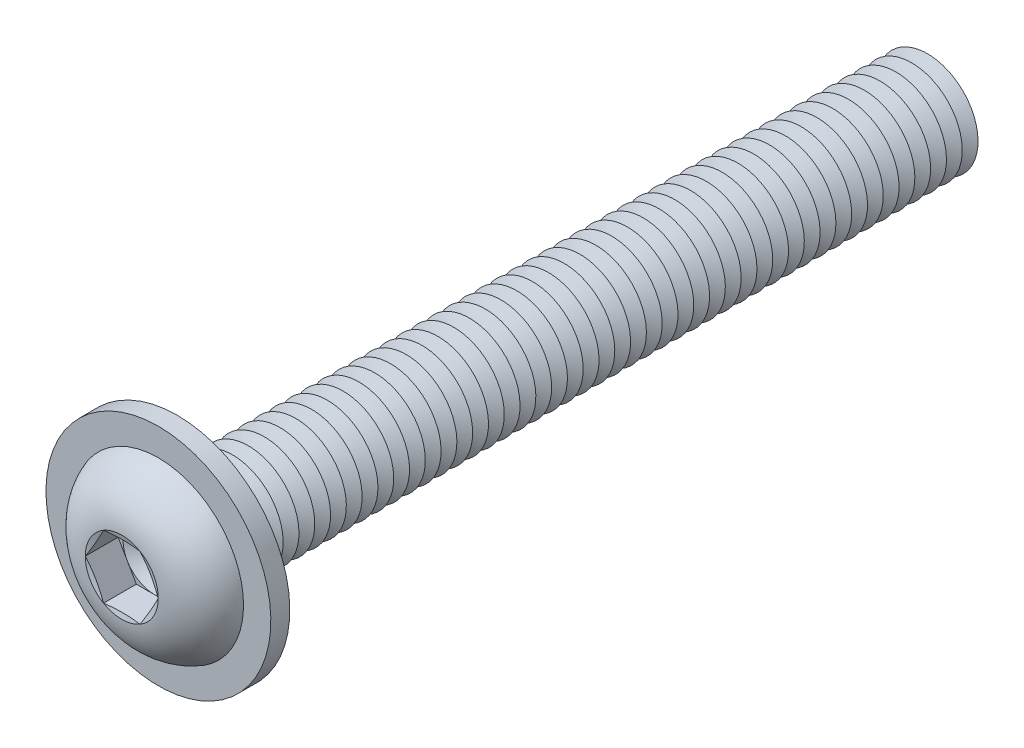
ISO-10303-21;
HEADER;
FILE_DESCRIPTION(('STEP AP214'),'2;1');
FILE_NAME('part.step','',(''),(''),'','','');
FILE_SCHEMA(('AUTOMOTIVE_DESIGN { 1 0 10303 214 1 1 1 1 }'));
ENDSEC;
DATA;
#1=APPLICATION_CONTEXT('core data for automotive mechanical design processes');
#2=APPLICATION_PROTOCOL_DEFINITION('international standard','automotive_design',2000,#1);
#3=PRODUCT_CONTEXT('',#1,'mechanical');
#4=PRODUCT('Part','Part','',(#3));
#5=PRODUCT_RELATED_PRODUCT_CATEGORY('part','',(#4));
#6=PRODUCT_DEFINITION_FORMATION('','',#4);
#7=PRODUCT_DEFINITION_CONTEXT('part definition',#1,'design');
#8=PRODUCT_DEFINITION('design','',#6,#7);
#9=PRODUCT_DEFINITION_SHAPE('','',#8);
#10=(LENGTH_UNIT() NAMED_UNIT(*) SI_UNIT(.MILLI.,.METRE.));
#11=(NAMED_UNIT(*) PLANE_ANGLE_UNIT() SI_UNIT($,.RADIAN.));
#12=(NAMED_UNIT(*) SI_UNIT($,.STERADIAN.) SOLID_ANGLE_UNIT());
#13=UNCERTAINTY_MEASURE_WITH_UNIT(LENGTH_MEASURE(1.E-05),#10,'distance_accuracy_value','');
#14=(GEOMETRIC_REPRESENTATION_CONTEXT(3) GLOBAL_UNCERTAINTY_ASSIGNED_CONTEXT((#13)) GLOBAL_UNIT_ASSIGNED_CONTEXT((#10,
#11,#12)) REPRESENTATION_CONTEXT('',''));
#15=CARTESIAN_POINT('',(0.,0.,0.));
#16=DIRECTION('',(0.,0.,1.));
#17=DIRECTION('',(1.,0.,0.));
#18=AXIS2_PLACEMENT_3D('',#15,#16,#17);
#19=CARTESIAN_POINT('',(0.,0.,-55.625));
#20=DIRECTION('',(0.,0.,1.));
#21=DIRECTION('',(0.,-1.,0.));
#22=AXIS2_PLACEMENT_3D('',#19,#20,#21);
#23=CONICAL_SURFACE('',#22,3.99999999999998,1.0471975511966);
#24=CARTESIAN_POINT('',(0.,0.,-56.25));
#25=DIRECTION('',(0.,0.,1.));
#26=DIRECTION('',(0.,-1.,0.));
#27=AXIS2_PLACEMENT_3D('',#24,#25,#26);
#28=CIRCLE('',#27,2.91746824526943);
#29=CARTESIAN_POINT('',(0.,-2.9174682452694,-56.25));
#30=VERTEX_POINT('',#29);
#31=EDGE_CURVE('E592',#30,#30,#28,.T.);
#32=ORIENTED_EDGE('',*,*,#31,.T.);
#33=EDGE_LOOP('',(#32));
#34=FACE_BOUND('',#33,.T.);
#35=CARTESIAN_POINT('',(0.,0.,-55.625));
#36=DIRECTION('',(0.,0.,1.));
#37=DIRECTION('',(0.,-1.,0.));
#38=AXIS2_PLACEMENT_3D('',#35,#36,#37);
#39=CIRCLE('',#38,3.99999999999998);
#40=CARTESIAN_POINT('',(0.,-3.99999999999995,-55.625));
#41=VERTEX_POINT('',#40);
#42=EDGE_CURVE('E588',#41,#41,#39,.T.);
#43=ORIENTED_EDGE('',*,*,#42,.F.);
#44=EDGE_LOOP('',(#43));
#45=FACE_BOUND('',#44,.T.);
#46=ADVANCED_FACE('F39',(#34,#45),#23,.T.);
#47=CARTESIAN_POINT('',(0.,0.,-56.25));
#48=DIRECTION('',(0.,0.,-1.));
#49=DIRECTION('',(0.,1.,0.));
#50=AXIS2_PLACEMENT_3D('',#47,#48,#49);
#51=CONICAL_SURFACE('',#50,2.91746824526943,1.0471975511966);
#52=CARTESIAN_POINT('',(0.,0.,-56.875));
#53=DIRECTION('',(0.,0.,1.));
#54=DIRECTION('',(0.,-1.,0.));
#55=AXIS2_PLACEMENT_3D('',#52,#53,#54);
#56=CIRCLE('',#55,3.99999999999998);
#57=CARTESIAN_POINT('',(0.,-3.99999999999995,-56.875));
#58=VERTEX_POINT('',#57);
#59=EDGE_CURVE('E596',#58,#58,#56,.T.);
#60=ORIENTED_EDGE('',*,*,#59,.T.);
#61=EDGE_LOOP('',(#60));
#62=FACE_BOUND('',#61,.T.);
#63=ORIENTED_EDGE('',*,*,#31,.F.);
#64=EDGE_LOOP('',(#63));
#65=FACE_BOUND('',#64,.T.);
#66=ADVANCED_FACE('F712',(#62,#65),#51,.T.);
#67=CARTESIAN_POINT('',(0.,3.99999999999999,-60.));
#68=DIRECTION('',(0.,0.,-1.));
#69=DIRECTION('',(0.,1.,0.));
#70=AXIS2_PLACEMENT_3D('',#67,#68,#69);
#71=PLANE('',#70);
#72=CARTESIAN_POINT('',(0.,0.,-60.));
#73=DIRECTION('',(0.,0.,1.));
#74=DIRECTION('',(0.,-1.,0.));
#75=AXIS2_PLACEMENT_3D('',#72,#73,#74);
#76=CIRCLE('',#75,2.91746824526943);
#77=CARTESIAN_POINT('',(0.,-2.9174682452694,-60.));
#78=VERTEX_POINT('',#77);
#79=EDGE_CURVE('E616',#78,#78,#76,.T.);
#80=ORIENTED_EDGE('',*,*,#79,.F.);
#81=EDGE_LOOP('',(#80));
#82=FACE_BOUND('',#81,.T.);
#83=ADVANCED_FACE('F718',(#82),#71,.T.);
#84=CARTESIAN_POINT('',(0.,0.,-59.375));
#85=DIRECTION('',(0.,0.,1.));
#86=DIRECTION('',(0.,-1.,0.));
#87=AXIS2_PLACEMENT_3D('',#84,#85,#86);
#88=CONICAL_SURFACE('',#87,3.99999999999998,1.0471975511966);
#89=ORIENTED_EDGE('',*,*,#79,.T.);
#90=EDGE_LOOP('',(#89));
#91=FACE_BOUND('',#90,.T.);
#92=CARTESIAN_POINT('',(0.,0.,-59.375));
#93=DIRECTION('',(0.,0.,1.));
#94=DIRECTION('',(0.,-1.,0.));
#95=AXIS2_PLACEMENT_3D('',#92,#93,#94);
#96=CIRCLE('',#95,3.99999999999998);
#97=CARTESIAN_POINT('',(0.,-3.99999999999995,-59.375));
#98=VERTEX_POINT('',#97);
#99=EDGE_CURVE('E612',#98,#98,#96,.T.);
#100=ORIENTED_EDGE('',*,*,#99,.F.);
#101=EDGE_LOOP('',(#100));
#102=FACE_BOUND('',#101,.T.);
#103=ADVANCED_FACE('F737',(#91,#102),#88,.T.);
#104=CARTESIAN_POINT('',(0.,0.,-58.75));
#105=DIRECTION('',(0.,0.,-1.));
#106=DIRECTION('',(0.,1.,0.));
#107=AXIS2_PLACEMENT_3D('',#104,#105,#106);
#108=CONICAL_SURFACE('',#107,2.91746824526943,1.0471975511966);
#109=ORIENTED_EDGE('',*,*,#99,.T.);
#110=EDGE_LOOP('',(#109));
#111=FACE_BOUND('',#110,.T.);
#112=CARTESIAN_POINT('',(0.,0.,-58.75));
#113=DIRECTION('',(0.,0.,1.));
#114=DIRECTION('',(0.,-1.,0.));
#115=AXIS2_PLACEMENT_3D('',#112,#113,#114);
#116=CIRCLE('',#115,2.91746824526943);
#117=CARTESIAN_POINT('',(0.,-2.9174682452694,-58.75));
#118=VERTEX_POINT('',#117);
#119=EDGE_CURVE('E608',#118,#118,#116,.T.);
#120=ORIENTED_EDGE('',*,*,#119,.F.);
#121=EDGE_LOOP('',(#120));
#122=FACE_BOUND('',#121,.T.);
#123=ADVANCED_FACE('F734',(#111,#122),#108,.T.);
#124=CARTESIAN_POINT('',(0.,0.,-58.125));
#125=DIRECTION('',(0.,0.,1.));
#126=DIRECTION('',(0.,-1.,0.));
#127=AXIS2_PLACEMENT_3D('',#124,#125,#126);
#128=CONICAL_SURFACE('',#127,3.99999999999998,1.0471975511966);
#129=ORIENTED_EDGE('',*,*,#119,.T.);
#130=EDGE_LOOP('',(#129));
#131=FACE_BOUND('',#130,.T.);
#132=CARTESIAN_POINT('',(0.,0.,-58.125));
#133=DIRECTION('',(0.,0.,1.));
#134=DIRECTION('',(0.,-1.,0.));
#135=AXIS2_PLACEMENT_3D('',#132,#133,#134);
#136=CIRCLE('',#135,3.99999999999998);
#137=CARTESIAN_POINT('',(0.,-3.99999999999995,-58.125));
#138=VERTEX_POINT('',#137);
#139=EDGE_CURVE('E604',#138,#138,#136,.T.);
#140=ORIENTED_EDGE('',*,*,#139,.F.);
#141=EDGE_LOOP('',(#140));
#142=FACE_BOUND('',#141,.T.);
#143=ADVANCED_FACE('F728',(#131,#142),#128,.T.);
#144=CARTESIAN_POINT('',(0.,0.,-57.5));
#145=DIRECTION('',(0.,0.,-1.));
#146=DIRECTION('',(0.,1.,0.));
#147=AXIS2_PLACEMENT_3D('',#144,#145,#146);
#148=CONICAL_SURFACE('',#147,2.91746824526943,1.0471975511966);
#149=ORIENTED_EDGE('',*,*,#139,.T.);
#150=EDGE_LOOP('',(#149));
#151=FACE_BOUND('',#150,.T.);
#152=CARTESIAN_POINT('',(0.,0.,-57.5));
#153=DIRECTION('',(0.,0.,1.));
#154=DIRECTION('',(0.,-1.,0.));
#155=AXIS2_PLACEMENT_3D('',#152,#153,#154);
#156=CIRCLE('',#155,2.91746824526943);
#157=CARTESIAN_POINT('',(0.,-2.9174682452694,-57.5));
#158=VERTEX_POINT('',#157);
#159=EDGE_CURVE('E600',#158,#158,#156,.T.);
#160=ORIENTED_EDGE('',*,*,#159,.F.);
#161=EDGE_LOOP('',(#160));
#162=FACE_BOUND('',#161,.T.);
#163=ADVANCED_FACE('F724',(#151,#162),#148,.T.);
#164=CARTESIAN_POINT('',(0.,0.,-56.875));
#165=DIRECTION('',(0.,0.,1.));
#166=DIRECTION('',(0.,-1.,0.));
#167=AXIS2_PLACEMENT_3D('',#164,#165,#166);
#168=CONICAL_SURFACE('',#167,3.99999999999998,1.0471975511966);
#169=ORIENTED_EDGE('',*,*,#159,.T.);
#170=EDGE_LOOP('',(#169));
#171=FACE_BOUND('',#170,.T.);
#172=ORIENTED_EDGE('',*,*,#59,.F.);
#173=EDGE_LOOP('',(#172));
#174=FACE_BOUND('',#173,.T.);
#175=ADVANCED_FACE('F727',(#171,#174),#168,.T.);
#176=CARTESIAN_POINT('',(0.,0.,-54.375));
#177=DIRECTION('',(0.,0.,1.));
#178=DIRECTION('',(0.,-1.,0.));
#179=AXIS2_PLACEMENT_3D('',#176,#177,#178);
#180=CONICAL_SURFACE('',#179,3.99999999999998,1.0471975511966);
#181=CARTESIAN_POINT('',(0.,0.,-55.));
#182=DIRECTION('',(0.,0.,1.));
#183=DIRECTION('',(0.,-1.,0.));
#184=AXIS2_PLACEMENT_3D('',#181,#182,#183);
#185=CIRCLE('',#184,2.91746824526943);
#186=CARTESIAN_POINT('',(0.,-2.9174682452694,-55.));
#187=VERTEX_POINT('',#186);
#188=EDGE_CURVE('E584',#187,#187,#185,.T.);
#189=ORIENTED_EDGE('',*,*,#188,.T.);
#190=EDGE_LOOP('',(#189));
#191=FACE_BOUND('',#190,.T.);
#192=CARTESIAN_POINT('',(0.,0.,-54.375));
#193=DIRECTION('',(0.,0.,1.));
#194=DIRECTION('',(0.,-1.,0.));
#195=AXIS2_PLACEMENT_3D('',#192,#193,#194);
#196=CIRCLE('',#195,3.99999999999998);
#197=CARTESIAN_POINT('',(0.,-3.99999999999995,-54.375));
#198=VERTEX_POINT('',#197);
#199=EDGE_CURVE('E580',#198,#198,#196,.T.);
#200=ORIENTED_EDGE('',*,*,#199,.F.);
#201=EDGE_LOOP('',(#200));
#202=FACE_BOUND('',#201,.T.);
#203=ADVANCED_FACE('F732',(#191,#202),#180,.T.);
#204=CARTESIAN_POINT('',(0.,0.,-55.));
#205=DIRECTION('',(0.,0.,-1.));
#206=DIRECTION('',(0.,1.,0.));
#207=AXIS2_PLACEMENT_3D('',#204,#205,#206);
#208=CONICAL_SURFACE('',#207,2.91746824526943,1.0471975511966);
#209=ORIENTED_EDGE('',*,*,#42,.T.);
#210=EDGE_LOOP('',(#209));
#211=FACE_BOUND('',#210,.T.);
#212=ORIENTED_EDGE('',*,*,#188,.F.);
#213=EDGE_LOOP('',(#212));
#214=FACE_BOUND('',#213,.T.);
#215=ADVANCED_FACE('F783',(#211,#214),#208,.T.);
#216=CARTESIAN_POINT('',(0.,0.,-53.125));
#217=DIRECTION('',(0.,0.,1.));
#218=DIRECTION('',(0.,-1.,0.));
#219=AXIS2_PLACEMENT_3D('',#216,#217,#218);
#220=CONICAL_SURFACE('',#219,3.99999999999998,1.0471975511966);
#221=CARTESIAN_POINT('',(0.,0.,-53.75));
#222=DIRECTION('',(0.,0.,1.));
#223=DIRECTION('',(0.,-1.,0.));
#224=AXIS2_PLACEMENT_3D('',#221,#222,#223);
#225=CIRCLE('',#224,2.91746824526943);
#226=CARTESIAN_POINT('',(0.,-2.9174682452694,-53.75));
#227=VERTEX_POINT('',#226);
#228=EDGE_CURVE('E576',#227,#227,#225,.T.);
#229=ORIENTED_EDGE('',*,*,#228,.T.);
#230=EDGE_LOOP('',(#229));
#231=FACE_BOUND('',#230,.T.);
#232=CARTESIAN_POINT('',(0.,0.,-53.125));
#233=DIRECTION('',(0.,0.,1.));
#234=DIRECTION('',(0.,-1.,0.));
#235=AXIS2_PLACEMENT_3D('',#232,#233,#234);
#236=CIRCLE('',#235,3.99999999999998);
#237=CARTESIAN_POINT('',(0.,-3.99999999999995,-53.125));
#238=VERTEX_POINT('',#237);
#239=EDGE_CURVE('E572',#238,#238,#236,.T.);
#240=ORIENTED_EDGE('',*,*,#239,.F.);
#241=EDGE_LOOP('',(#240));
#242=FACE_BOUND('',#241,.T.);
#243=ADVANCED_FACE('F789',(#231,#242),#220,.T.);
#244=CARTESIAN_POINT('',(0.,0.,-53.75));
#245=DIRECTION('',(0.,0.,-1.));
#246=DIRECTION('',(0.,1.,0.));
#247=AXIS2_PLACEMENT_3D('',#244,#245,#246);
#248=CONICAL_SURFACE('',#247,2.91746824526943,1.0471975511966);
#249=ORIENTED_EDGE('',*,*,#199,.T.);
#250=EDGE_LOOP('',(#249));
#251=FACE_BOUND('',#250,.T.);
#252=ORIENTED_EDGE('',*,*,#228,.F.);
#253=EDGE_LOOP('',(#252));
#254=FACE_BOUND('',#253,.T.);
#255=ADVANCED_FACE('F796',(#251,#254),#248,.T.);
#256=CARTESIAN_POINT('',(0.,0.,-51.875));
#257=DIRECTION('',(0.,0.,1.));
#258=DIRECTION('',(0.,-1.,0.));
#259=AXIS2_PLACEMENT_3D('',#256,#257,#258);
#260=CONICAL_SURFACE('',#259,3.99999999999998,1.0471975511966);
#261=CARTESIAN_POINT('',(0.,0.,-52.5));
#262=DIRECTION('',(0.,0.,1.));
#263=DIRECTION('',(0.,-1.,0.));
#264=AXIS2_PLACEMENT_3D('',#261,#262,#263);
#265=CIRCLE('',#264,2.91746824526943);
#266=CARTESIAN_POINT('',(0.,-2.9174682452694,-52.5));
#267=VERTEX_POINT('',#266);
#268=EDGE_CURVE('E568',#267,#267,#265,.T.);
#269=ORIENTED_EDGE('',*,*,#268,.T.);
#270=EDGE_LOOP('',(#269));
#271=FACE_BOUND('',#270,.T.);
#272=CARTESIAN_POINT('',(0.,0.,-51.875));
#273=DIRECTION('',(0.,0.,1.));
#274=DIRECTION('',(0.,-1.,0.));
#275=AXIS2_PLACEMENT_3D('',#272,#273,#274);
#276=CIRCLE('',#275,3.99999999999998);
#277=CARTESIAN_POINT('',(0.,-3.99999999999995,-51.875));
#278=VERTEX_POINT('',#277);
#279=EDGE_CURVE('E564',#278,#278,#276,.T.);
#280=ORIENTED_EDGE('',*,*,#279,.F.);
#281=EDGE_LOOP('',(#280));
#282=FACE_BOUND('',#281,.T.);
#283=ADVANCED_FACE('F803',(#271,#282),#260,.T.);
#284=CARTESIAN_POINT('',(0.,0.,-52.5));
#285=DIRECTION('',(0.,0.,-1.));
#286=DIRECTION('',(0.,1.,0.));
#287=AXIS2_PLACEMENT_3D('',#284,#285,#286);
#288=CONICAL_SURFACE('',#287,2.91746824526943,1.0471975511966);
#289=ORIENTED_EDGE('',*,*,#239,.T.);
#290=EDGE_LOOP('',(#289));
#291=FACE_BOUND('',#290,.T.);
#292=ORIENTED_EDGE('',*,*,#268,.F.);
#293=EDGE_LOOP('',(#292));
#294=FACE_BOUND('',#293,.T.);
#295=ADVANCED_FACE('F810',(#291,#294),#288,.T.);
#296=CARTESIAN_POINT('',(0.,0.,-50.625));
#297=DIRECTION('',(0.,0.,1.));
#298=DIRECTION('',(0.,-1.,0.));
#299=AXIS2_PLACEMENT_3D('',#296,#297,#298);
#300=CONICAL_SURFACE('',#299,3.99999999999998,1.0471975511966);
#301=CARTESIAN_POINT('',(0.,0.,-51.25));
#302=DIRECTION('',(0.,0.,1.));
#303=DIRECTION('',(0.,-1.,0.));
#304=AXIS2_PLACEMENT_3D('',#301,#302,#303);
#305=CIRCLE('',#304,2.91746824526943);
#306=CARTESIAN_POINT('',(0.,-2.9174682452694,-51.25));
#307=VERTEX_POINT('',#306);
#308=EDGE_CURVE('E560',#307,#307,#305,.T.);
#309=ORIENTED_EDGE('',*,*,#308,.T.);
#310=EDGE_LOOP('',(#309));
#311=FACE_BOUND('',#310,.T.);
#312=CARTESIAN_POINT('',(0.,0.,-50.625));
#313=DIRECTION('',(0.,0.,1.));
#314=DIRECTION('',(0.,-1.,0.));
#315=AXIS2_PLACEMENT_3D('',#312,#313,#314);
#316=CIRCLE('',#315,3.99999999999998);
#317=CARTESIAN_POINT('',(0.,-3.99999999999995,-50.625));
#318=VERTEX_POINT('',#317);
#319=EDGE_CURVE('E556',#318,#318,#316,.T.);
#320=ORIENTED_EDGE('',*,*,#319,.F.);
#321=EDGE_LOOP('',(#320));
#322=FACE_BOUND('',#321,.T.);
#323=ADVANCED_FACE('F817',(#311,#322),#300,.T.);
#324=CARTESIAN_POINT('',(0.,0.,-51.25));
#325=DIRECTION('',(0.,0.,-1.));
#326=DIRECTION('',(0.,1.,0.));
#327=AXIS2_PLACEMENT_3D('',#324,#325,#326);
#328=CONICAL_SURFACE('',#327,2.91746824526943,1.0471975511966);
#329=ORIENTED_EDGE('',*,*,#279,.T.);
#330=EDGE_LOOP('',(#329));
#331=FACE_BOUND('',#330,.T.);
#332=ORIENTED_EDGE('',*,*,#308,.F.);
#333=EDGE_LOOP('',(#332));
#334=FACE_BOUND('',#333,.T.);
#335=ADVANCED_FACE('F824',(#331,#334),#328,.T.);
#336=CARTESIAN_POINT('',(0.,0.,-49.375));
#337=DIRECTION('',(0.,0.,1.));
#338=DIRECTION('',(0.,-1.,0.));
#339=AXIS2_PLACEMENT_3D('',#336,#337,#338);
#340=CONICAL_SURFACE('',#339,3.99999999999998,1.0471975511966);
#341=CARTESIAN_POINT('',(0.,0.,-50.));
#342=DIRECTION('',(0.,0.,1.));
#343=DIRECTION('',(0.,-1.,0.));
#344=AXIS2_PLACEMENT_3D('',#341,#342,#343);
#345=CIRCLE('',#344,2.91746824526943);
#346=CARTESIAN_POINT('',(0.,-2.9174682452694,-50.));
#347=VERTEX_POINT('',#346);
#348=EDGE_CURVE('E552',#347,#347,#345,.T.);
#349=ORIENTED_EDGE('',*,*,#348,.T.);
#350=EDGE_LOOP('',(#349));
#351=FACE_BOUND('',#350,.T.);
#352=CARTESIAN_POINT('',(0.,0.,-49.375));
#353=DIRECTION('',(0.,0.,1.));
#354=DIRECTION('',(0.,-1.,0.));
#355=AXIS2_PLACEMENT_3D('',#352,#353,#354);
#356=CIRCLE('',#355,3.99999999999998);
#357=CARTESIAN_POINT('',(0.,-3.99999999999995,-49.375));
#358=VERTEX_POINT('',#357);
#359=EDGE_CURVE('E548',#358,#358,#356,.T.);
#360=ORIENTED_EDGE('',*,*,#359,.F.);
#361=EDGE_LOOP('',(#360));
#362=FACE_BOUND('',#361,.T.);
#363=ADVANCED_FACE('F831',(#351,#362),#340,.T.);
#364=CARTESIAN_POINT('',(0.,0.,-50.));
#365=DIRECTION('',(0.,0.,-1.));
#366=DIRECTION('',(0.,1.,0.));
#367=AXIS2_PLACEMENT_3D('',#364,#365,#366);
#368=CONICAL_SURFACE('',#367,2.91746824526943,1.0471975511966);
#369=ORIENTED_EDGE('',*,*,#319,.T.);
#370=EDGE_LOOP('',(#369));
#371=FACE_BOUND('',#370,.T.);
#372=ORIENTED_EDGE('',*,*,#348,.F.);
#373=EDGE_LOOP('',(#372));
#374=FACE_BOUND('',#373,.T.);
#375=ADVANCED_FACE('F838',(#371,#374),#368,.T.);
#376=CARTESIAN_POINT('',(0.,0.,-48.125));
#377=DIRECTION('',(0.,0.,1.));
#378=DIRECTION('',(0.,-1.,0.));
#379=AXIS2_PLACEMENT_3D('',#376,#377,#378);
#380=CONICAL_SURFACE('',#379,3.99999999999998,1.0471975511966);
#381=CARTESIAN_POINT('',(0.,0.,-48.75));
#382=DIRECTION('',(0.,0.,1.));
#383=DIRECTION('',(0.,-1.,0.));
#384=AXIS2_PLACEMENT_3D('',#381,#382,#383);
#385=CIRCLE('',#384,2.91746824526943);
#386=CARTESIAN_POINT('',(0.,-2.9174682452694,-48.75));
#387=VERTEX_POINT('',#386);
#388=EDGE_CURVE('E544',#387,#387,#385,.T.);
#389=ORIENTED_EDGE('',*,*,#388,.T.);
#390=EDGE_LOOP('',(#389));
#391=FACE_BOUND('',#390,.T.);
#392=CARTESIAN_POINT('',(0.,0.,-48.125));
#393=DIRECTION('',(0.,0.,1.));
#394=DIRECTION('',(0.,-1.,0.));
#395=AXIS2_PLACEMENT_3D('',#392,#393,#394);
#396=CIRCLE('',#395,3.99999999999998);
#397=CARTESIAN_POINT('',(0.,-3.99999999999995,-48.125));
#398=VERTEX_POINT('',#397);
#399=EDGE_CURVE('E540',#398,#398,#396,.T.);
#400=ORIENTED_EDGE('',*,*,#399,.F.);
#401=EDGE_LOOP('',(#400));
#402=FACE_BOUND('',#401,.T.);
#403=ADVANCED_FACE('F845',(#391,#402),#380,.T.);
#404=CARTESIAN_POINT('',(0.,0.,-48.75));
#405=DIRECTION('',(0.,0.,-1.));
#406=DIRECTION('',(0.,1.,0.));
#407=AXIS2_PLACEMENT_3D('',#404,#405,#406);
#408=CONICAL_SURFACE('',#407,2.91746824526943,1.0471975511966);
#409=ORIENTED_EDGE('',*,*,#359,.T.);
#410=EDGE_LOOP('',(#409));
#411=FACE_BOUND('',#410,.T.);
#412=ORIENTED_EDGE('',*,*,#388,.F.);
#413=EDGE_LOOP('',(#412));
#414=FACE_BOUND('',#413,.T.);
#415=ADVANCED_FACE('F852',(#411,#414),#408,.T.);
#416=CARTESIAN_POINT('',(0.,0.,-46.875));
#417=DIRECTION('',(0.,0.,1.));
#418=DIRECTION('',(0.,-1.,0.));
#419=AXIS2_PLACEMENT_3D('',#416,#417,#418);
#420=CONICAL_SURFACE('',#419,3.99999999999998,1.0471975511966);
#421=CARTESIAN_POINT('',(0.,0.,-47.5));
#422=DIRECTION('',(0.,0.,1.));
#423=DIRECTION('',(0.,-1.,0.));
#424=AXIS2_PLACEMENT_3D('',#421,#422,#423);
#425=CIRCLE('',#424,2.91746824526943);
#426=CARTESIAN_POINT('',(0.,-2.91746824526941,-47.5));
#427=VERTEX_POINT('',#426);
#428=EDGE_CURVE('E536',#427,#427,#425,.T.);
#429=ORIENTED_EDGE('',*,*,#428,.T.);
#430=EDGE_LOOP('',(#429));
#431=FACE_BOUND('',#430,.T.);
#432=CARTESIAN_POINT('',(0.,0.,-46.875));
#433=DIRECTION('',(0.,0.,1.));
#434=DIRECTION('',(0.,-1.,0.));
#435=AXIS2_PLACEMENT_3D('',#432,#433,#434);
#436=CIRCLE('',#435,3.99999999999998);
#437=CARTESIAN_POINT('',(0.,-3.99999999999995,-46.875));
#438=VERTEX_POINT('',#437);
#439=EDGE_CURVE('E532',#438,#438,#436,.T.);
#440=ORIENTED_EDGE('',*,*,#439,.F.);
#441=EDGE_LOOP('',(#440));
#442=FACE_BOUND('',#441,.T.);
#443=ADVANCED_FACE('F859',(#431,#442),#420,.T.);
#444=CARTESIAN_POINT('',(0.,0.,-47.5));
#445=DIRECTION('',(0.,0.,-1.));
#446=DIRECTION('',(0.,1.,0.));
#447=AXIS2_PLACEMENT_3D('',#444,#445,#446);
#448=CONICAL_SURFACE('',#447,2.91746824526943,1.0471975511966);
#449=ORIENTED_EDGE('',*,*,#399,.T.);
#450=EDGE_LOOP('',(#449));
#451=FACE_BOUND('',#450,.T.);
#452=ORIENTED_EDGE('',*,*,#428,.F.);
#453=EDGE_LOOP('',(#452));
#454=FACE_BOUND('',#453,.T.);
#455=ADVANCED_FACE('F866',(#451,#454),#448,.T.);
#456=CARTESIAN_POINT('',(0.,0.,-45.625));
#457=DIRECTION('',(0.,0.,1.));
#458=DIRECTION('',(0.,-1.,0.));
#459=AXIS2_PLACEMENT_3D('',#456,#457,#458);
#460=CONICAL_SURFACE('',#459,3.99999999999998,1.0471975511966);
#461=CARTESIAN_POINT('',(0.,0.,-46.25));
#462=DIRECTION('',(0.,0.,1.));
#463=DIRECTION('',(0.,-1.,0.));
#464=AXIS2_PLACEMENT_3D('',#461,#462,#463);
#465=CIRCLE('',#464,2.91746824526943);
#466=CARTESIAN_POINT('',(0.,-2.91746824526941,-46.25));
#467=VERTEX_POINT('',#466);
#468=EDGE_CURVE('E528',#467,#467,#465,.T.);
#469=ORIENTED_EDGE('',*,*,#468,.T.);
#470=EDGE_LOOP('',(#469));
#471=FACE_BOUND('',#470,.T.);
#472=CARTESIAN_POINT('',(0.,0.,-45.625));
#473=DIRECTION('',(0.,0.,1.));
#474=DIRECTION('',(0.,-1.,0.));
#475=AXIS2_PLACEMENT_3D('',#472,#473,#474);
#476=CIRCLE('',#475,3.99999999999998);
#477=CARTESIAN_POINT('',(0.,-3.99999999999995,-45.625));
#478=VERTEX_POINT('',#477);
#479=EDGE_CURVE('E524',#478,#478,#476,.T.);
#480=ORIENTED_EDGE('',*,*,#479,.F.);
#481=EDGE_LOOP('',(#480));
#482=FACE_BOUND('',#481,.T.);
#483=ADVANCED_FACE('F873',(#471,#482),#460,.T.);
#484=CARTESIAN_POINT('',(0.,0.,-46.25));
#485=DIRECTION('',(0.,0.,-1.));
#486=DIRECTION('',(0.,1.,0.));
#487=AXIS2_PLACEMENT_3D('',#484,#485,#486);
#488=CONICAL_SURFACE('',#487,2.91746824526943,1.0471975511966);
#489=ORIENTED_EDGE('',*,*,#439,.T.);
#490=EDGE_LOOP('',(#489));
#491=FACE_BOUND('',#490,.T.);
#492=ORIENTED_EDGE('',*,*,#468,.F.);
#493=EDGE_LOOP('',(#492));
#494=FACE_BOUND('',#493,.T.);
#495=ADVANCED_FACE('F880',(#491,#494),#488,.T.);
#496=CARTESIAN_POINT('',(0.,0.,-44.375));
#497=DIRECTION('',(0.,0.,1.));
#498=DIRECTION('',(0.,-1.,0.));
#499=AXIS2_PLACEMENT_3D('',#496,#497,#498);
#500=CONICAL_SURFACE('',#499,3.99999999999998,1.0471975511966);
#501=CARTESIAN_POINT('',(0.,0.,-45.));
#502=DIRECTION('',(0.,0.,1.));
#503=DIRECTION('',(0.,-1.,0.));
#504=AXIS2_PLACEMENT_3D('',#501,#502,#503);
#505=CIRCLE('',#504,2.91746824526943);
#506=CARTESIAN_POINT('',(0.,-2.91746824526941,-45.));
#507=VERTEX_POINT('',#506);
#508=EDGE_CURVE('E520',#507,#507,#505,.T.);
#509=ORIENTED_EDGE('',*,*,#508,.T.);
#510=EDGE_LOOP('',(#509));
#511=FACE_BOUND('',#510,.T.);
#512=CARTESIAN_POINT('',(0.,0.,-44.375));
#513=DIRECTION('',(0.,0.,1.));
#514=DIRECTION('',(0.,-1.,0.));
#515=AXIS2_PLACEMENT_3D('',#512,#513,#514);
#516=CIRCLE('',#515,3.99999999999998);
#517=CARTESIAN_POINT('',(0.,-3.99999999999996,-44.375));
#518=VERTEX_POINT('',#517);
#519=EDGE_CURVE('E516',#518,#518,#516,.T.);
#520=ORIENTED_EDGE('',*,*,#519,.F.);
#521=EDGE_LOOP('',(#520));
#522=FACE_BOUND('',#521,.T.);
#523=ADVANCED_FACE('F887',(#511,#522),#500,.T.);
#524=CARTESIAN_POINT('',(0.,0.,-45.));
#525=DIRECTION('',(0.,0.,-1.));
#526=DIRECTION('',(0.,1.,0.));
#527=AXIS2_PLACEMENT_3D('',#524,#525,#526);
#528=CONICAL_SURFACE('',#527,2.91746824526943,1.0471975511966);
#529=ORIENTED_EDGE('',*,*,#479,.T.);
#530=EDGE_LOOP('',(#529));
#531=FACE_BOUND('',#530,.T.);
#532=ORIENTED_EDGE('',*,*,#508,.F.);
#533=EDGE_LOOP('',(#532));
#534=FACE_BOUND('',#533,.T.);
#535=ADVANCED_FACE('F894',(#531,#534),#528,.T.);
#536=CARTESIAN_POINT('',(0.,0.,-43.125));
#537=DIRECTION('',(0.,0.,1.));
#538=DIRECTION('',(0.,-1.,0.));
#539=AXIS2_PLACEMENT_3D('',#536,#537,#538);
#540=CONICAL_SURFACE('',#539,3.99999999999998,1.0471975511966);
#541=CARTESIAN_POINT('',(0.,0.,-43.75));
#542=DIRECTION('',(0.,0.,1.));
#543=DIRECTION('',(0.,-1.,0.));
#544=AXIS2_PLACEMENT_3D('',#541,#542,#543);
#545=CIRCLE('',#544,2.91746824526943);
#546=CARTESIAN_POINT('',(0.,-2.91746824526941,-43.75));
#547=VERTEX_POINT('',#546);
#548=EDGE_CURVE('E512',#547,#547,#545,.T.);
#549=ORIENTED_EDGE('',*,*,#548,.T.);
#550=EDGE_LOOP('',(#549));
#551=FACE_BOUND('',#550,.T.);
#552=CARTESIAN_POINT('',(0.,0.,-43.125));
#553=DIRECTION('',(0.,0.,1.));
#554=DIRECTION('',(0.,-1.,0.));
#555=AXIS2_PLACEMENT_3D('',#552,#553,#554);
#556=CIRCLE('',#555,3.99999999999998);
#557=CARTESIAN_POINT('',(0.,-3.99999999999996,-43.125));
#558=VERTEX_POINT('',#557);
#559=EDGE_CURVE('E508',#558,#558,#556,.T.);
#560=ORIENTED_EDGE('',*,*,#559,.F.);
#561=EDGE_LOOP('',(#560));
#562=FACE_BOUND('',#561,.T.);
#563=ADVANCED_FACE('F901',(#551,#562),#540,.T.);
#564=CARTESIAN_POINT('',(0.,0.,-43.75));
#565=DIRECTION('',(0.,0.,-1.));
#566=DIRECTION('',(0.,1.,0.));
#567=AXIS2_PLACEMENT_3D('',#564,#565,#566);
#568=CONICAL_SURFACE('',#567,2.91746824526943,1.0471975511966);
#569=ORIENTED_EDGE('',*,*,#519,.T.);
#570=EDGE_LOOP('',(#569));
#571=FACE_BOUND('',#570,.T.);
#572=ORIENTED_EDGE('',*,*,#548,.F.);
#573=EDGE_LOOP('',(#572));
#574=FACE_BOUND('',#573,.T.);
#575=ADVANCED_FACE('F908',(#571,#574),#568,.T.);
#576=CARTESIAN_POINT('',(0.,0.,-41.875));
#577=DIRECTION('',(0.,0.,1.));
#578=DIRECTION('',(0.,-1.,0.));
#579=AXIS2_PLACEMENT_3D('',#576,#577,#578);
#580=CONICAL_SURFACE('',#579,3.99999999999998,1.0471975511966);
#581=CARTESIAN_POINT('',(0.,0.,-42.5));
#582=DIRECTION('',(0.,0.,1.));
#583=DIRECTION('',(0.,-1.,0.));
#584=AXIS2_PLACEMENT_3D('',#581,#582,#583);
#585=CIRCLE('',#584,2.91746824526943);
#586=CARTESIAN_POINT('',(0.,-2.91746824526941,-42.5));
#587=VERTEX_POINT('',#586);
#588=EDGE_CURVE('E504',#587,#587,#585,.T.);
#589=ORIENTED_EDGE('',*,*,#588,.T.);
#590=EDGE_LOOP('',(#589));
#591=FACE_BOUND('',#590,.T.);
#592=CARTESIAN_POINT('',(0.,0.,-41.875));
#593=DIRECTION('',(0.,0.,1.));
#594=DIRECTION('',(0.,-1.,0.));
#595=AXIS2_PLACEMENT_3D('',#592,#593,#594);
#596=CIRCLE('',#595,3.99999999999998);
#597=CARTESIAN_POINT('',(0.,-3.99999999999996,-41.875));
#598=VERTEX_POINT('',#597);
#599=EDGE_CURVE('E500',#598,#598,#596,.T.);
#600=ORIENTED_EDGE('',*,*,#599,.F.);
#601=EDGE_LOOP('',(#600));
#602=FACE_BOUND('',#601,.T.);
#603=ADVANCED_FACE('F915',(#591,#602),#580,.T.);
#604=CARTESIAN_POINT('',(0.,0.,-42.5));
#605=DIRECTION('',(0.,0.,-1.));
#606=DIRECTION('',(0.,1.,0.));
#607=AXIS2_PLACEMENT_3D('',#604,#605,#606);
#608=CONICAL_SURFACE('',#607,2.91746824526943,1.0471975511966);
#609=ORIENTED_EDGE('',*,*,#559,.T.);
#610=EDGE_LOOP('',(#609));
#611=FACE_BOUND('',#610,.T.);
#612=ORIENTED_EDGE('',*,*,#588,.F.);
#613=EDGE_LOOP('',(#612));
#614=FACE_BOUND('',#613,.T.);
#615=ADVANCED_FACE('F922',(#611,#614),#608,.T.);
#616=CARTESIAN_POINT('',(0.,0.,-40.625));
#617=DIRECTION('',(0.,0.,1.));
#618=DIRECTION('',(0.,-1.,0.));
#619=AXIS2_PLACEMENT_3D('',#616,#617,#618);
#620=CONICAL_SURFACE('',#619,3.99999999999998,1.0471975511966);
#621=CARTESIAN_POINT('',(0.,0.,-41.25));
#622=DIRECTION('',(0.,0.,1.));
#623=DIRECTION('',(0.,-1.,0.));
#624=AXIS2_PLACEMENT_3D('',#621,#622,#623);
#625=CIRCLE('',#624,2.91746824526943);
#626=CARTESIAN_POINT('',(0.,-2.91746824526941,-41.25));
#627=VERTEX_POINT('',#626);
#628=EDGE_CURVE('E496',#627,#627,#625,.T.);
#629=ORIENTED_EDGE('',*,*,#628,.T.);
#630=EDGE_LOOP('',(#629));
#631=FACE_BOUND('',#630,.T.);
#632=CARTESIAN_POINT('',(0.,0.,-40.625));
#633=DIRECTION('',(0.,0.,1.));
#634=DIRECTION('',(0.,-1.,0.));
#635=AXIS2_PLACEMENT_3D('',#632,#633,#634);
#636=CIRCLE('',#635,3.99999999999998);
#637=CARTESIAN_POINT('',(0.,-3.99999999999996,-40.625));
#638=VERTEX_POINT('',#637);
#639=EDGE_CURVE('E492',#638,#638,#636,.T.);
#640=ORIENTED_EDGE('',*,*,#639,.F.);
#641=EDGE_LOOP('',(#640));
#642=FACE_BOUND('',#641,.T.);
#643=ADVANCED_FACE('F929',(#631,#642),#620,.T.);
#644=CARTESIAN_POINT('',(0.,0.,-41.25));
#645=DIRECTION('',(0.,0.,-1.));
#646=DIRECTION('',(0.,1.,0.));
#647=AXIS2_PLACEMENT_3D('',#644,#645,#646);
#648=CONICAL_SURFACE('',#647,2.91746824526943,1.0471975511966);
#649=ORIENTED_EDGE('',*,*,#599,.T.);
#650=EDGE_LOOP('',(#649));
#651=FACE_BOUND('',#650,.T.);
#652=ORIENTED_EDGE('',*,*,#628,.F.);
#653=EDGE_LOOP('',(#652));
#654=FACE_BOUND('',#653,.T.);
#655=ADVANCED_FACE('F936',(#651,#654),#648,.T.);
#656=CARTESIAN_POINT('',(0.,0.,-39.375));
#657=DIRECTION('',(0.,0.,1.));
#658=DIRECTION('',(0.,-1.,0.));
#659=AXIS2_PLACEMENT_3D('',#656,#657,#658);
#660=CONICAL_SURFACE('',#659,3.99999999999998,1.0471975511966);
#661=CARTESIAN_POINT('',(0.,0.,-40.));
#662=DIRECTION('',(0.,0.,1.));
#663=DIRECTION('',(0.,-1.,0.));
#664=AXIS2_PLACEMENT_3D('',#661,#662,#663);
#665=CIRCLE('',#664,2.91746824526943);
#666=CARTESIAN_POINT('',(0.,-2.91746824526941,-40.));
#667=VERTEX_POINT('',#666);
#668=EDGE_CURVE('E488',#667,#667,#665,.T.);
#669=ORIENTED_EDGE('',*,*,#668,.T.);
#670=EDGE_LOOP('',(#669));
#671=FACE_BOUND('',#670,.T.);
#672=CARTESIAN_POINT('',(0.,0.,-39.375));
#673=DIRECTION('',(0.,0.,1.));
#674=DIRECTION('',(0.,-1.,0.));
#675=AXIS2_PLACEMENT_3D('',#672,#673,#674);
#676=CIRCLE('',#675,3.99999999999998);
#677=CARTESIAN_POINT('',(0.,-3.99999999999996,-39.375));
#678=VERTEX_POINT('',#677);
#679=EDGE_CURVE('E484',#678,#678,#676,.T.);
#680=ORIENTED_EDGE('',*,*,#679,.F.);
#681=EDGE_LOOP('',(#680));
#682=FACE_BOUND('',#681,.T.);
#683=ADVANCED_FACE('F943',(#671,#682),#660,.T.);
#684=CARTESIAN_POINT('',(0.,0.,-40.));
#685=DIRECTION('',(0.,0.,-1.));
#686=DIRECTION('',(0.,1.,0.));
#687=AXIS2_PLACEMENT_3D('',#684,#685,#686);
#688=CONICAL_SURFACE('',#687,2.91746824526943,1.0471975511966);
#689=ORIENTED_EDGE('',*,*,#639,.T.);
#690=EDGE_LOOP('',(#689));
#691=FACE_BOUND('',#690,.T.);
#692=ORIENTED_EDGE('',*,*,#668,.F.);
#693=EDGE_LOOP('',(#692));
#694=FACE_BOUND('',#693,.T.);
#695=ADVANCED_FACE('F950',(#691,#694),#688,.T.);
#696=CARTESIAN_POINT('',(0.,0.,-38.125));
#697=DIRECTION('',(0.,0.,1.));
#698=DIRECTION('',(0.,-1.,0.));
#699=AXIS2_PLACEMENT_3D('',#696,#697,#698);
#700=CONICAL_SURFACE('',#699,3.99999999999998,1.0471975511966);
#701=CARTESIAN_POINT('',(0.,0.,-38.75));
#702=DIRECTION('',(0.,0.,1.));
#703=DIRECTION('',(0.,-1.,0.));
#704=AXIS2_PLACEMENT_3D('',#701,#702,#703);
#705=CIRCLE('',#704,2.91746824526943);
#706=CARTESIAN_POINT('',(0.,-2.91746824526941,-38.75));
#707=VERTEX_POINT('',#706);
#708=EDGE_CURVE('E480',#707,#707,#705,.T.);
#709=ORIENTED_EDGE('',*,*,#708,.T.);
#710=EDGE_LOOP('',(#709));
#711=FACE_BOUND('',#710,.T.);
#712=CARTESIAN_POINT('',(0.,0.,-38.125));
#713=DIRECTION('',(0.,0.,1.));
#714=DIRECTION('',(0.,-1.,0.));
#715=AXIS2_PLACEMENT_3D('',#712,#713,#714);
#716=CIRCLE('',#715,3.99999999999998);
#717=CARTESIAN_POINT('',(0.,-3.99999999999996,-38.125));
#718=VERTEX_POINT('',#717);
#719=EDGE_CURVE('E476',#718,#718,#716,.T.);
#720=ORIENTED_EDGE('',*,*,#719,.F.);
#721=EDGE_LOOP('',(#720));
#722=FACE_BOUND('',#721,.T.);
#723=ADVANCED_FACE('F957',(#711,#722),#700,.T.);
#724=CARTESIAN_POINT('',(0.,0.,-38.75));
#725=DIRECTION('',(0.,0.,-1.));
#726=DIRECTION('',(0.,1.,0.));
#727=AXIS2_PLACEMENT_3D('',#724,#725,#726);
#728=CONICAL_SURFACE('',#727,2.91746824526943,1.0471975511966);
#729=ORIENTED_EDGE('',*,*,#679,.T.);
#730=EDGE_LOOP('',(#729));
#731=FACE_BOUND('',#730,.T.);
#732=ORIENTED_EDGE('',*,*,#708,.F.);
#733=EDGE_LOOP('',(#732));
#734=FACE_BOUND('',#733,.T.);
#735=ADVANCED_FACE('F964',(#731,#734),#728,.T.);
#736=CARTESIAN_POINT('',(0.,0.,-36.875));
#737=DIRECTION('',(0.,0.,1.));
#738=DIRECTION('',(0.,-1.,0.));
#739=AXIS2_PLACEMENT_3D('',#736,#737,#738);
#740=CONICAL_SURFACE('',#739,3.99999999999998,1.0471975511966);
#741=CARTESIAN_POINT('',(0.,0.,-37.5));
#742=DIRECTION('',(0.,0.,1.));
#743=DIRECTION('',(0.,-1.,0.));
#744=AXIS2_PLACEMENT_3D('',#741,#742,#743);
#745=CIRCLE('',#744,2.91746824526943);
#746=CARTESIAN_POINT('',(0.,-2.91746824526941,-37.5));
#747=VERTEX_POINT('',#746);
#748=EDGE_CURVE('E472',#747,#747,#745,.T.);
#749=ORIENTED_EDGE('',*,*,#748,.T.);
#750=EDGE_LOOP('',(#749));
#751=FACE_BOUND('',#750,.T.);
#752=CARTESIAN_POINT('',(0.,0.,-36.875));
#753=DIRECTION('',(0.,0.,1.));
#754=DIRECTION('',(0.,-1.,0.));
#755=AXIS2_PLACEMENT_3D('',#752,#753,#754);
#756=CIRCLE('',#755,3.99999999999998);
#757=CARTESIAN_POINT('',(0.,-3.99999999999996,-36.875));
#758=VERTEX_POINT('',#757);
#759=EDGE_CURVE('E468',#758,#758,#756,.T.);
#760=ORIENTED_EDGE('',*,*,#759,.F.);
#761=EDGE_LOOP('',(#760));
#762=FACE_BOUND('',#761,.T.);
#763=ADVANCED_FACE('F971',(#751,#762),#740,.T.);
#764=CARTESIAN_POINT('',(0.,0.,-37.5));
#765=DIRECTION('',(0.,0.,-1.));
#766=DIRECTION('',(0.,1.,0.));
#767=AXIS2_PLACEMENT_3D('',#764,#765,#766);
#768=CONICAL_SURFACE('',#767,2.91746824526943,1.0471975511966);
#769=ORIENTED_EDGE('',*,*,#719,.T.);
#770=EDGE_LOOP('',(#769));
#771=FACE_BOUND('',#770,.T.);
#772=ORIENTED_EDGE('',*,*,#748,.F.);
#773=EDGE_LOOP('',(#772));
#774=FACE_BOUND('',#773,.T.);
#775=ADVANCED_FACE('F978',(#771,#774),#768,.T.);
#776=CARTESIAN_POINT('',(0.,0.,-35.625));
#777=DIRECTION('',(0.,0.,1.));
#778=DIRECTION('',(0.,-1.,0.));
#779=AXIS2_PLACEMENT_3D('',#776,#777,#778);
#780=CONICAL_SURFACE('',#779,3.99999999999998,1.0471975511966);
#781=CARTESIAN_POINT('',(0.,0.,-36.25));
#782=DIRECTION('',(0.,0.,1.));
#783=DIRECTION('',(0.,-1.,0.));
#784=AXIS2_PLACEMENT_3D('',#781,#782,#783);
#785=CIRCLE('',#784,2.91746824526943);
#786=CARTESIAN_POINT('',(0.,-2.91746824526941,-36.25));
#787=VERTEX_POINT('',#786);
#788=EDGE_CURVE('E464',#787,#787,#785,.T.);
#789=ORIENTED_EDGE('',*,*,#788,.T.);
#790=EDGE_LOOP('',(#789));
#791=FACE_BOUND('',#790,.T.);
#792=CARTESIAN_POINT('',(0.,0.,-35.625));
#793=DIRECTION('',(0.,0.,1.));
#794=DIRECTION('',(0.,-1.,0.));
#795=AXIS2_PLACEMENT_3D('',#792,#793,#794);
#796=CIRCLE('',#795,3.99999999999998);
#797=CARTESIAN_POINT('',(0.,-3.99999999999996,-35.625));
#798=VERTEX_POINT('',#797);
#799=EDGE_CURVE('E460',#798,#798,#796,.T.);
#800=ORIENTED_EDGE('',*,*,#799,.F.);
#801=EDGE_LOOP('',(#800));
#802=FACE_BOUND('',#801,.T.);
#803=ADVANCED_FACE('F985',(#791,#802),#780,.T.);
#804=CARTESIAN_POINT('',(0.,0.,-36.25));
#805=DIRECTION('',(0.,0.,-1.));
#806=DIRECTION('',(0.,1.,0.));
#807=AXIS2_PLACEMENT_3D('',#804,#805,#806);
#808=CONICAL_SURFACE('',#807,2.91746824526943,1.0471975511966);
#809=ORIENTED_EDGE('',*,*,#759,.T.);
#810=EDGE_LOOP('',(#809));
#811=FACE_BOUND('',#810,.T.);
#812=ORIENTED_EDGE('',*,*,#788,.F.);
#813=EDGE_LOOP('',(#812));
#814=FACE_BOUND('',#813,.T.);
#815=ADVANCED_FACE('F992',(#811,#814),#808,.T.);
#816=CARTESIAN_POINT('',(0.,0.,-34.375));
#817=DIRECTION('',(0.,0.,1.));
#818=DIRECTION('',(0.,-1.,0.));
#819=AXIS2_PLACEMENT_3D('',#816,#817,#818);
#820=CONICAL_SURFACE('',#819,3.99999999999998,1.0471975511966);
#821=CARTESIAN_POINT('',(0.,0.,-35.));
#822=DIRECTION('',(0.,0.,1.));
#823=DIRECTION('',(0.,-1.,0.));
#824=AXIS2_PLACEMENT_3D('',#821,#822,#823);
#825=CIRCLE('',#824,2.91746824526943);
#826=CARTESIAN_POINT('',(0.,-2.91746824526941,-35.));
#827=VERTEX_POINT('',#826);
#828=EDGE_CURVE('E456',#827,#827,#825,.T.);
#829=ORIENTED_EDGE('',*,*,#828,.T.);
#830=EDGE_LOOP('',(#829));
#831=FACE_BOUND('',#830,.T.);
#832=CARTESIAN_POINT('',(0.,0.,-34.375));
#833=DIRECTION('',(0.,0.,1.));
#834=DIRECTION('',(0.,-1.,0.));
#835=AXIS2_PLACEMENT_3D('',#832,#833,#834);
#836=CIRCLE('',#835,3.99999999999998);
#837=CARTESIAN_POINT('',(0.,-3.99999999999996,-34.375));
#838=VERTEX_POINT('',#837);
#839=EDGE_CURVE('E452',#838,#838,#836,.T.);
#840=ORIENTED_EDGE('',*,*,#839,.F.);
#841=EDGE_LOOP('',(#840));
#842=FACE_BOUND('',#841,.T.);
#843=ADVANCED_FACE('F999',(#831,#842),#820,.T.);
#844=CARTESIAN_POINT('',(0.,0.,-35.));
#845=DIRECTION('',(0.,0.,-1.));
#846=DIRECTION('',(0.,1.,0.));
#847=AXIS2_PLACEMENT_3D('',#844,#845,#846);
#848=CONICAL_SURFACE('',#847,2.91746824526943,1.0471975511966);
#849=ORIENTED_EDGE('',*,*,#799,.T.);
#850=EDGE_LOOP('',(#849));
#851=FACE_BOUND('',#850,.T.);
#852=ORIENTED_EDGE('',*,*,#828,.F.);
#853=EDGE_LOOP('',(#852));
#854=FACE_BOUND('',#853,.T.);
#855=ADVANCED_FACE('F1006',(#851,#854),#848,.T.);
#856=CARTESIAN_POINT('',(0.,0.,-33.125));
#857=DIRECTION('',(0.,0.,1.));
#858=DIRECTION('',(0.,-1.,0.));
#859=AXIS2_PLACEMENT_3D('',#856,#857,#858);
#860=CONICAL_SURFACE('',#859,3.99999999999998,1.0471975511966);
#861=CARTESIAN_POINT('',(0.,0.,-33.75));
#862=DIRECTION('',(0.,0.,1.));
#863=DIRECTION('',(0.,-1.,0.));
#864=AXIS2_PLACEMENT_3D('',#861,#862,#863);
#865=CIRCLE('',#864,2.91746824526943);
#866=CARTESIAN_POINT('',(0.,-2.91746824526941,-33.75));
#867=VERTEX_POINT('',#866);
#868=EDGE_CURVE('E448',#867,#867,#865,.T.);
#869=ORIENTED_EDGE('',*,*,#868,.T.);
#870=EDGE_LOOP('',(#869));
#871=FACE_BOUND('',#870,.T.);
#872=CARTESIAN_POINT('',(0.,0.,-33.125));
#873=DIRECTION('',(0.,0.,1.));
#874=DIRECTION('',(0.,-1.,0.));
#875=AXIS2_PLACEMENT_3D('',#872,#873,#874);
#876=CIRCLE('',#875,3.99999999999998);
#877=CARTESIAN_POINT('',(0.,-3.99999999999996,-33.125));
#878=VERTEX_POINT('',#877);
#879=EDGE_CURVE('E444',#878,#878,#876,.T.);
#880=ORIENTED_EDGE('',*,*,#879,.F.);
#881=EDGE_LOOP('',(#880));
#882=FACE_BOUND('',#881,.T.);
#883=ADVANCED_FACE('F1013',(#871,#882),#860,.T.);
#884=CARTESIAN_POINT('',(0.,0.,-33.75));
#885=DIRECTION('',(0.,0.,-1.));
#886=DIRECTION('',(0.,1.,0.));
#887=AXIS2_PLACEMENT_3D('',#884,#885,#886);
#888=CONICAL_SURFACE('',#887,2.91746824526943,1.0471975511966);
#889=ORIENTED_EDGE('',*,*,#839,.T.);
#890=EDGE_LOOP('',(#889));
#891=FACE_BOUND('',#890,.T.);
#892=ORIENTED_EDGE('',*,*,#868,.F.);
#893=EDGE_LOOP('',(#892));
#894=FACE_BOUND('',#893,.T.);
#895=ADVANCED_FACE('F1020',(#891,#894),#888,.T.);
#896=CARTESIAN_POINT('',(0.,0.,-31.875));
#897=DIRECTION('',(0.,0.,1.));
#898=DIRECTION('',(0.,-1.,0.));
#899=AXIS2_PLACEMENT_3D('',#896,#897,#898);
#900=CONICAL_SURFACE('',#899,3.99999999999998,1.0471975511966);
#901=CARTESIAN_POINT('',(0.,0.,-32.5));
#902=DIRECTION('',(0.,0.,1.));
#903=DIRECTION('',(0.,-1.,0.));
#904=AXIS2_PLACEMENT_3D('',#901,#902,#903);
#905=CIRCLE('',#904,2.91746824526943);
#906=CARTESIAN_POINT('',(0.,-2.91746824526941,-32.5));
#907=VERTEX_POINT('',#906);
#908=EDGE_CURVE('E440',#907,#907,#905,.T.);
#909=ORIENTED_EDGE('',*,*,#908,.T.);
#910=EDGE_LOOP('',(#909));
#911=FACE_BOUND('',#910,.T.);
#912=CARTESIAN_POINT('',(0.,0.,-31.875));
#913=DIRECTION('',(0.,0.,1.));
#914=DIRECTION('',(0.,-1.,0.));
#915=AXIS2_PLACEMENT_3D('',#912,#913,#914);
#916=CIRCLE('',#915,3.99999999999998);
#917=CARTESIAN_POINT('',(0.,-3.99999999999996,-31.875));
#918=VERTEX_POINT('',#917);
#919=EDGE_CURVE('E436',#918,#918,#916,.T.);
#920=ORIENTED_EDGE('',*,*,#919,.F.);
#921=EDGE_LOOP('',(#920));
#922=FACE_BOUND('',#921,.T.);
#923=ADVANCED_FACE('F1027',(#911,#922),#900,.T.);
#924=CARTESIAN_POINT('',(0.,0.,-32.5));
#925=DIRECTION('',(0.,0.,-1.));
#926=DIRECTION('',(0.,1.,0.));
#927=AXIS2_PLACEMENT_3D('',#924,#925,#926);
#928=CONICAL_SURFACE('',#927,2.91746824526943,1.0471975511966);
#929=ORIENTED_EDGE('',*,*,#879,.T.);
#930=EDGE_LOOP('',(#929));
#931=FACE_BOUND('',#930,.T.);
#932=ORIENTED_EDGE('',*,*,#908,.F.);
#933=EDGE_LOOP('',(#932));
#934=FACE_BOUND('',#933,.T.);
#935=ADVANCED_FACE('F1034',(#931,#934),#928,.T.);
#936=CARTESIAN_POINT('',(0.,0.,-30.625));
#937=DIRECTION('',(0.,0.,1.));
#938=DIRECTION('',(0.,-1.,0.));
#939=AXIS2_PLACEMENT_3D('',#936,#937,#938);
#940=CONICAL_SURFACE('',#939,3.99999999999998,1.0471975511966);
#941=CARTESIAN_POINT('',(0.,0.,-31.25));
#942=DIRECTION('',(0.,0.,1.));
#943=DIRECTION('',(0.,-1.,0.));
#944=AXIS2_PLACEMENT_3D('',#941,#942,#943);
#945=CIRCLE('',#944,2.91746824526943);
#946=CARTESIAN_POINT('',(0.,-2.91746824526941,-31.25));
#947=VERTEX_POINT('',#946);
#948=EDGE_CURVE('E432',#947,#947,#945,.T.);
#949=ORIENTED_EDGE('',*,*,#948,.T.);
#950=EDGE_LOOP('',(#949));
#951=FACE_BOUND('',#950,.T.);
#952=CARTESIAN_POINT('',(0.,0.,-30.625));
#953=DIRECTION('',(0.,0.,1.));
#954=DIRECTION('',(0.,-1.,0.));
#955=AXIS2_PLACEMENT_3D('',#952,#953,#954);
#956=CIRCLE('',#955,3.99999999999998);
#957=CARTESIAN_POINT('',(0.,-3.99999999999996,-30.625));
#958=VERTEX_POINT('',#957);
#959=EDGE_CURVE('E428',#958,#958,#956,.T.);
#960=ORIENTED_EDGE('',*,*,#959,.F.);
#961=EDGE_LOOP('',(#960));
#962=FACE_BOUND('',#961,.T.);
#963=ADVANCED_FACE('F1041',(#951,#962),#940,.T.);
#964=CARTESIAN_POINT('',(0.,0.,-31.25));
#965=DIRECTION('',(0.,0.,-1.));
#966=DIRECTION('',(0.,1.,0.));
#967=AXIS2_PLACEMENT_3D('',#964,#965,#966);
#968=CONICAL_SURFACE('',#967,2.91746824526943,1.0471975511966);
#969=ORIENTED_EDGE('',*,*,#919,.T.);
#970=EDGE_LOOP('',(#969));
#971=FACE_BOUND('',#970,.T.);
#972=ORIENTED_EDGE('',*,*,#948,.F.);
#973=EDGE_LOOP('',(#972));
#974=FACE_BOUND('',#973,.T.);
#975=ADVANCED_FACE('F1048',(#971,#974),#968,.T.);
#976=CARTESIAN_POINT('',(0.,0.,-29.375));
#977=DIRECTION('',(0.,0.,1.));
#978=DIRECTION('',(0.,-1.,0.));
#979=AXIS2_PLACEMENT_3D('',#976,#977,#978);
#980=CONICAL_SURFACE('',#979,3.99999999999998,1.0471975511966);
#981=CARTESIAN_POINT('',(0.,0.,-30.));
#982=DIRECTION('',(0.,0.,1.));
#983=DIRECTION('',(0.,-1.,0.));
#984=AXIS2_PLACEMENT_3D('',#981,#982,#983);
#985=CIRCLE('',#984,2.91746824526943);
#986=CARTESIAN_POINT('',(0.,-2.91746824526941,-30.));
#987=VERTEX_POINT('',#986);
#988=EDGE_CURVE('E424',#987,#987,#985,.T.);
#989=ORIENTED_EDGE('',*,*,#988,.T.);
#990=EDGE_LOOP('',(#989));
#991=FACE_BOUND('',#990,.T.);
#992=CARTESIAN_POINT('',(0.,0.,-29.375));
#993=DIRECTION('',(0.,0.,1.));
#994=DIRECTION('',(0.,-1.,0.));
#995=AXIS2_PLACEMENT_3D('',#992,#993,#994);
#996=CIRCLE('',#995,3.99999999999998);
#997=CARTESIAN_POINT('',(0.,-3.99999999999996,-29.375));
#998=VERTEX_POINT('',#997);
#999=EDGE_CURVE('E420',#998,#998,#996,.T.);
#1000=ORIENTED_EDGE('',*,*,#999,.F.);
#1001=EDGE_LOOP('',(#1000));
#1002=FACE_BOUND('',#1001,.T.);
#1003=ADVANCED_FACE('F1055',(#991,#1002),#980,.T.);
#1004=CARTESIAN_POINT('',(0.,0.,-30.));
#1005=DIRECTION('',(0.,0.,-1.));
#1006=DIRECTION('',(0.,1.,0.));
#1007=AXIS2_PLACEMENT_3D('',#1004,#1005,#1006);
#1008=CONICAL_SURFACE('',#1007,2.91746824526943,1.0471975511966);
#1009=ORIENTED_EDGE('',*,*,#959,.T.);
#1010=EDGE_LOOP('',(#1009));
#1011=FACE_BOUND('',#1010,.T.);
#1012=ORIENTED_EDGE('',*,*,#988,.F.);
#1013=EDGE_LOOP('',(#1012));
#1014=FACE_BOUND('',#1013,.T.);
#1015=ADVANCED_FACE('F1062',(#1011,#1014),#1008,.T.);
#1016=CARTESIAN_POINT('',(0.,0.,-28.125));
#1017=DIRECTION('',(0.,0.,1.));
#1018=DIRECTION('',(0.,-1.,0.));
#1019=AXIS2_PLACEMENT_3D('',#1016,#1017,#1018);
#1020=CONICAL_SURFACE('',#1019,3.99999999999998,1.0471975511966);
#1021=CARTESIAN_POINT('',(0.,0.,-28.75));
#1022=DIRECTION('',(0.,0.,1.));
#1023=DIRECTION('',(0.,-1.,0.));
#1024=AXIS2_PLACEMENT_3D('',#1021,#1022,#1023);
#1025=CIRCLE('',#1024,2.91746824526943);
#1026=CARTESIAN_POINT('',(0.,-2.91746824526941,-28.75));
#1027=VERTEX_POINT('',#1026);
#1028=EDGE_CURVE('E416',#1027,#1027,#1025,.T.);
#1029=ORIENTED_EDGE('',*,*,#1028,.T.);
#1030=EDGE_LOOP('',(#1029));
#1031=FACE_BOUND('',#1030,.T.);
#1032=CARTESIAN_POINT('',(0.,0.,-28.125));
#1033=DIRECTION('',(0.,0.,1.));
#1034=DIRECTION('',(0.,-1.,0.));
#1035=AXIS2_PLACEMENT_3D('',#1032,#1033,#1034);
#1036=CIRCLE('',#1035,3.99999999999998);
#1037=CARTESIAN_POINT('',(0.,-3.99999999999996,-28.125));
#1038=VERTEX_POINT('',#1037);
#1039=EDGE_CURVE('E412',#1038,#1038,#1036,.T.);
#1040=ORIENTED_EDGE('',*,*,#1039,.F.);
#1041=EDGE_LOOP('',(#1040));
#1042=FACE_BOUND('',#1041,.T.);
#1043=ADVANCED_FACE('F1069',(#1031,#1042),#1020,.T.);
#1044=CARTESIAN_POINT('',(0.,0.,-28.75));
#1045=DIRECTION('',(0.,0.,-1.));
#1046=DIRECTION('',(0.,1.,0.));
#1047=AXIS2_PLACEMENT_3D('',#1044,#1045,#1046);
#1048=CONICAL_SURFACE('',#1047,2.91746824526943,1.0471975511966);
#1049=ORIENTED_EDGE('',*,*,#999,.T.);
#1050=EDGE_LOOP('',(#1049));
#1051=FACE_BOUND('',#1050,.T.);
#1052=ORIENTED_EDGE('',*,*,#1028,.F.);
#1053=EDGE_LOOP('',(#1052));
#1054=FACE_BOUND('',#1053,.T.);
#1055=ADVANCED_FACE('F1076',(#1051,#1054),#1048,.T.);
#1056=CARTESIAN_POINT('',(0.,0.,-26.875));
#1057=DIRECTION('',(0.,0.,1.));
#1058=DIRECTION('',(0.,-1.,0.));
#1059=AXIS2_PLACEMENT_3D('',#1056,#1057,#1058);
#1060=CONICAL_SURFACE('',#1059,3.99999999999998,1.0471975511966);
#1061=CARTESIAN_POINT('',(0.,0.,-27.5));
#1062=DIRECTION('',(0.,0.,1.));
#1063=DIRECTION('',(0.,-1.,0.));
#1064=AXIS2_PLACEMENT_3D('',#1061,#1062,#1063);
#1065=CIRCLE('',#1064,2.91746824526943);
#1066=CARTESIAN_POINT('',(0.,-2.91746824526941,-27.5));
#1067=VERTEX_POINT('',#1066);
#1068=EDGE_CURVE('E408',#1067,#1067,#1065,.T.);
#1069=ORIENTED_EDGE('',*,*,#1068,.T.);
#1070=EDGE_LOOP('',(#1069));
#1071=FACE_BOUND('',#1070,.T.);
#1072=CARTESIAN_POINT('',(0.,0.,-26.875));
#1073=DIRECTION('',(0.,0.,1.));
#1074=DIRECTION('',(0.,-1.,0.));
#1075=AXIS2_PLACEMENT_3D('',#1072,#1073,#1074);
#1076=CIRCLE('',#1075,3.99999999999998);
#1077=CARTESIAN_POINT('',(0.,-3.99999999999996,-26.875));
#1078=VERTEX_POINT('',#1077);
#1079=EDGE_CURVE('E404',#1078,#1078,#1076,.T.);
#1080=ORIENTED_EDGE('',*,*,#1079,.F.);
#1081=EDGE_LOOP('',(#1080));
#1082=FACE_BOUND('',#1081,.T.);
#1083=ADVANCED_FACE('F1083',(#1071,#1082),#1060,.T.);
#1084=CARTESIAN_POINT('',(0.,0.,-27.5));
#1085=DIRECTION('',(0.,0.,-1.));
#1086=DIRECTION('',(0.,1.,0.));
#1087=AXIS2_PLACEMENT_3D('',#1084,#1085,#1086);
#1088=CONICAL_SURFACE('',#1087,2.91746824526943,1.0471975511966);
#1089=ORIENTED_EDGE('',*,*,#1039,.T.);
#1090=EDGE_LOOP('',(#1089));
#1091=FACE_BOUND('',#1090,.T.);
#1092=ORIENTED_EDGE('',*,*,#1068,.F.);
#1093=EDGE_LOOP('',(#1092));
#1094=FACE_BOUND('',#1093,.T.);
#1095=ADVANCED_FACE('F1090',(#1091,#1094),#1088,.T.);
#1096=CARTESIAN_POINT('',(0.,0.,-25.625));
#1097=DIRECTION('',(0.,0.,1.));
#1098=DIRECTION('',(0.,-1.,0.));
#1099=AXIS2_PLACEMENT_3D('',#1096,#1097,#1098);
#1100=CONICAL_SURFACE('',#1099,3.99999999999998,1.0471975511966);
#1101=CARTESIAN_POINT('',(0.,0.,-26.25));
#1102=DIRECTION('',(0.,0.,1.));
#1103=DIRECTION('',(0.,-1.,0.));
#1104=AXIS2_PLACEMENT_3D('',#1101,#1102,#1103);
#1105=CIRCLE('',#1104,2.91746824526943);
#1106=CARTESIAN_POINT('',(0.,-2.91746824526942,-26.25));
#1107=VERTEX_POINT('',#1106);
#1108=EDGE_CURVE('E400',#1107,#1107,#1105,.T.);
#1109=ORIENTED_EDGE('',*,*,#1108,.T.);
#1110=EDGE_LOOP('',(#1109));
#1111=FACE_BOUND('',#1110,.T.);
#1112=CARTESIAN_POINT('',(0.,0.,-25.625));
#1113=DIRECTION('',(0.,0.,1.));
#1114=DIRECTION('',(0.,-1.,0.));
#1115=AXIS2_PLACEMENT_3D('',#1112,#1113,#1114);
#1116=CIRCLE('',#1115,3.99999999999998);
#1117=CARTESIAN_POINT('',(0.,-3.99999999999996,-25.625));
#1118=VERTEX_POINT('',#1117);
#1119=EDGE_CURVE('E396',#1118,#1118,#1116,.T.);
#1120=ORIENTED_EDGE('',*,*,#1119,.F.);
#1121=EDGE_LOOP('',(#1120));
#1122=FACE_BOUND('',#1121,.T.);
#1123=ADVANCED_FACE('F1097',(#1111,#1122),#1100,.T.);
#1124=CARTESIAN_POINT('',(0.,0.,-26.25));
#1125=DIRECTION('',(0.,0.,-1.));
#1126=DIRECTION('',(0.,1.,0.));
#1127=AXIS2_PLACEMENT_3D('',#1124,#1125,#1126);
#1128=CONICAL_SURFACE('',#1127,2.91746824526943,1.0471975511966);
#1129=ORIENTED_EDGE('',*,*,#1079,.T.);
#1130=EDGE_LOOP('',(#1129));
#1131=FACE_BOUND('',#1130,.T.);
#1132=ORIENTED_EDGE('',*,*,#1108,.F.);
#1133=EDGE_LOOP('',(#1132));
#1134=FACE_BOUND('',#1133,.T.);
#1135=ADVANCED_FACE('F1104',(#1131,#1134),#1128,.T.);
#1136=CARTESIAN_POINT('',(0.,0.,-24.375));
#1137=DIRECTION('',(0.,0.,1.));
#1138=DIRECTION('',(0.,-1.,0.));
#1139=AXIS2_PLACEMENT_3D('',#1136,#1137,#1138);
#1140=CONICAL_SURFACE('',#1139,3.99999999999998,1.0471975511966);
#1141=CARTESIAN_POINT('',(0.,0.,-25.));
#1142=DIRECTION('',(0.,0.,1.));
#1143=DIRECTION('',(0.,-1.,0.));
#1144=AXIS2_PLACEMENT_3D('',#1141,#1142,#1143);
#1145=CIRCLE('',#1144,2.91746824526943);
#1146=CARTESIAN_POINT('',(0.,-2.91746824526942,-25.));
#1147=VERTEX_POINT('',#1146);
#1148=EDGE_CURVE('E392',#1147,#1147,#1145,.T.);
#1149=ORIENTED_EDGE('',*,*,#1148,.T.);
#1150=EDGE_LOOP('',(#1149));
#1151=FACE_BOUND('',#1150,.T.);
#1152=CARTESIAN_POINT('',(0.,0.,-24.375));
#1153=DIRECTION('',(0.,0.,1.));
#1154=DIRECTION('',(0.,-1.,0.));
#1155=AXIS2_PLACEMENT_3D('',#1152,#1153,#1154);
#1156=CIRCLE('',#1155,3.99999999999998);
#1157=CARTESIAN_POINT('',(0.,-3.99999999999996,-24.375));
#1158=VERTEX_POINT('',#1157);
#1159=EDGE_CURVE('E388',#1158,#1158,#1156,.T.);
#1160=ORIENTED_EDGE('',*,*,#1159,.F.);
#1161=EDGE_LOOP('',(#1160));
#1162=FACE_BOUND('',#1161,.T.);
#1163=ADVANCED_FACE('F1111',(#1151,#1162),#1140,.T.);
#1164=CARTESIAN_POINT('',(0.,0.,-25.));
#1165=DIRECTION('',(0.,0.,-1.));
#1166=DIRECTION('',(0.,1.,0.));
#1167=AXIS2_PLACEMENT_3D('',#1164,#1165,#1166);
#1168=CONICAL_SURFACE('',#1167,2.91746824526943,1.0471975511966);
#1169=ORIENTED_EDGE('',*,*,#1119,.T.);
#1170=EDGE_LOOP('',(#1169));
#1171=FACE_BOUND('',#1170,.T.);
#1172=ORIENTED_EDGE('',*,*,#1148,.F.);
#1173=EDGE_LOOP('',(#1172));
#1174=FACE_BOUND('',#1173,.T.);
#1175=ADVANCED_FACE('F1118',(#1171,#1174),#1168,.T.);
#1176=CARTESIAN_POINT('',(0.,0.,-23.125));
#1177=DIRECTION('',(0.,0.,1.));
#1178=DIRECTION('',(0.,-1.,0.));
#1179=AXIS2_PLACEMENT_3D('',#1176,#1177,#1178);
#1180=CONICAL_SURFACE('',#1179,3.99999999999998,1.0471975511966);
#1181=CARTESIAN_POINT('',(0.,0.,-23.75));
#1182=DIRECTION('',(0.,0.,1.));
#1183=DIRECTION('',(0.,-1.,0.));
#1184=AXIS2_PLACEMENT_3D('',#1181,#1182,#1183);
#1185=CIRCLE('',#1184,2.91746824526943);
#1186=CARTESIAN_POINT('',(0.,-2.91746824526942,-23.75));
#1187=VERTEX_POINT('',#1186);
#1188=EDGE_CURVE('E384',#1187,#1187,#1185,.T.);
#1189=ORIENTED_EDGE('',*,*,#1188,.T.);
#1190=EDGE_LOOP('',(#1189));
#1191=FACE_BOUND('',#1190,.T.);
#1192=CARTESIAN_POINT('',(0.,0.,-23.125));
#1193=DIRECTION('',(0.,0.,1.));
#1194=DIRECTION('',(0.,-1.,0.));
#1195=AXIS2_PLACEMENT_3D('',#1192,#1193,#1194);
#1196=CIRCLE('',#1195,3.99999999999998);
#1197=CARTESIAN_POINT('',(0.,-3.99999999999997,-23.125));
#1198=VERTEX_POINT('',#1197);
#1199=EDGE_CURVE('E380',#1198,#1198,#1196,.T.);
#1200=ORIENTED_EDGE('',*,*,#1199,.F.);
#1201=EDGE_LOOP('',(#1200));
#1202=FACE_BOUND('',#1201,.T.);
#1203=ADVANCED_FACE('F1125',(#1191,#1202),#1180,.T.);
#1204=CARTESIAN_POINT('',(0.,0.,-23.75));
#1205=DIRECTION('',(0.,0.,-1.));
#1206=DIRECTION('',(0.,1.,0.));
#1207=AXIS2_PLACEMENT_3D('',#1204,#1205,#1206);
#1208=CONICAL_SURFACE('',#1207,2.91746824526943,1.0471975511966);
#1209=ORIENTED_EDGE('',*,*,#1159,.T.);
#1210=EDGE_LOOP('',(#1209));
#1211=FACE_BOUND('',#1210,.T.);
#1212=ORIENTED_EDGE('',*,*,#1188,.F.);
#1213=EDGE_LOOP('',(#1212));
#1214=FACE_BOUND('',#1213,.T.);
#1215=ADVANCED_FACE('F1132',(#1211,#1214),#1208,.T.);
#1216=CARTESIAN_POINT('',(0.,0.,-21.875));
#1217=DIRECTION('',(0.,0.,1.));
#1218=DIRECTION('',(0.,-1.,0.));
#1219=AXIS2_PLACEMENT_3D('',#1216,#1217,#1218);
#1220=CONICAL_SURFACE('',#1219,3.99999999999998,1.0471975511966);
#1221=CARTESIAN_POINT('',(0.,0.,-22.5));
#1222=DIRECTION('',(0.,0.,1.));
#1223=DIRECTION('',(0.,-1.,0.));
#1224=AXIS2_PLACEMENT_3D('',#1221,#1222,#1223);
#1225=CIRCLE('',#1224,2.91746824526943);
#1226=CARTESIAN_POINT('',(0.,-2.91746824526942,-22.5));
#1227=VERTEX_POINT('',#1226);
#1228=EDGE_CURVE('E376',#1227,#1227,#1225,.T.);
#1229=ORIENTED_EDGE('',*,*,#1228,.T.);
#1230=EDGE_LOOP('',(#1229));
#1231=FACE_BOUND('',#1230,.T.);
#1232=CARTESIAN_POINT('',(0.,0.,-21.875));
#1233=DIRECTION('',(0.,0.,1.));
#1234=DIRECTION('',(0.,-1.,0.));
#1235=AXIS2_PLACEMENT_3D('',#1232,#1233,#1234);
#1236=CIRCLE('',#1235,3.99999999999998);
#1237=CARTESIAN_POINT('',(0.,-3.99999999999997,-21.875));
#1238=VERTEX_POINT('',#1237);
#1239=EDGE_CURVE('E372',#1238,#1238,#1236,.T.);
#1240=ORIENTED_EDGE('',*,*,#1239,.F.);
#1241=EDGE_LOOP('',(#1240));
#1242=FACE_BOUND('',#1241,.T.);
#1243=ADVANCED_FACE('F1139',(#1231,#1242),#1220,.T.);
#1244=CARTESIAN_POINT('',(0.,0.,-22.5));
#1245=DIRECTION('',(0.,0.,-1.));
#1246=DIRECTION('',(0.,1.,0.));
#1247=AXIS2_PLACEMENT_3D('',#1244,#1245,#1246);
#1248=CONICAL_SURFACE('',#1247,2.91746824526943,1.0471975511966);
#1249=ORIENTED_EDGE('',*,*,#1199,.T.);
#1250=EDGE_LOOP('',(#1249));
#1251=FACE_BOUND('',#1250,.T.);
#1252=ORIENTED_EDGE('',*,*,#1228,.F.);
#1253=EDGE_LOOP('',(#1252));
#1254=FACE_BOUND('',#1253,.T.);
#1255=ADVANCED_FACE('F1146',(#1251,#1254),#1248,.T.);
#1256=CARTESIAN_POINT('',(0.,0.,-20.625));
#1257=DIRECTION('',(0.,0.,1.));
#1258=DIRECTION('',(0.,-1.,0.));
#1259=AXIS2_PLACEMENT_3D('',#1256,#1257,#1258);
#1260=CONICAL_SURFACE('',#1259,3.99999999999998,1.0471975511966);
#1261=CARTESIAN_POINT('',(0.,0.,-21.25));
#1262=DIRECTION('',(0.,0.,1.));
#1263=DIRECTION('',(0.,-1.,0.));
#1264=AXIS2_PLACEMENT_3D('',#1261,#1262,#1263);
#1265=CIRCLE('',#1264,2.91746824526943);
#1266=CARTESIAN_POINT('',(0.,-2.91746824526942,-21.25));
#1267=VERTEX_POINT('',#1266);
#1268=EDGE_CURVE('E368',#1267,#1267,#1265,.T.);
#1269=ORIENTED_EDGE('',*,*,#1268,.T.);
#1270=EDGE_LOOP('',(#1269));
#1271=FACE_BOUND('',#1270,.T.);
#1272=CARTESIAN_POINT('',(0.,0.,-20.625));
#1273=DIRECTION('',(0.,0.,1.));
#1274=DIRECTION('',(0.,-1.,0.));
#1275=AXIS2_PLACEMENT_3D('',#1272,#1273,#1274);
#1276=CIRCLE('',#1275,3.99999999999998);
#1277=CARTESIAN_POINT('',(0.,-3.99999999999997,-20.625));
#1278=VERTEX_POINT('',#1277);
#1279=EDGE_CURVE('E364',#1278,#1278,#1276,.T.);
#1280=ORIENTED_EDGE('',*,*,#1279,.F.);
#1281=EDGE_LOOP('',(#1280));
#1282=FACE_BOUND('',#1281,.T.);
#1283=ADVANCED_FACE('F1153',(#1271,#1282),#1260,.T.);
#1284=CARTESIAN_POINT('',(0.,0.,-21.25));
#1285=DIRECTION('',(0.,0.,-1.));
#1286=DIRECTION('',(0.,1.,0.));
#1287=AXIS2_PLACEMENT_3D('',#1284,#1285,#1286);
#1288=CONICAL_SURFACE('',#1287,2.91746824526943,1.0471975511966);
#1289=ORIENTED_EDGE('',*,*,#1239,.T.);
#1290=EDGE_LOOP('',(#1289));
#1291=FACE_BOUND('',#1290,.T.);
#1292=ORIENTED_EDGE('',*,*,#1268,.F.);
#1293=EDGE_LOOP('',(#1292));
#1294=FACE_BOUND('',#1293,.T.);
#1295=ADVANCED_FACE('F1160',(#1291,#1294),#1288,.T.);
#1296=CARTESIAN_POINT('',(0.,0.,-19.375));
#1297=DIRECTION('',(0.,0.,1.));
#1298=DIRECTION('',(0.,-1.,0.));
#1299=AXIS2_PLACEMENT_3D('',#1296,#1297,#1298);
#1300=CONICAL_SURFACE('',#1299,3.99999999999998,1.0471975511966);
#1301=CARTESIAN_POINT('',(0.,0.,-20.));
#1302=DIRECTION('',(0.,0.,1.));
#1303=DIRECTION('',(0.,-1.,0.));
#1304=AXIS2_PLACEMENT_3D('',#1301,#1302,#1303);
#1305=CIRCLE('',#1304,2.91746824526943);
#1306=CARTESIAN_POINT('',(0.,-2.91746824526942,-20.));
#1307=VERTEX_POINT('',#1306);
#1308=EDGE_CURVE('E360',#1307,#1307,#1305,.T.);
#1309=ORIENTED_EDGE('',*,*,#1308,.T.);
#1310=EDGE_LOOP('',(#1309));
#1311=FACE_BOUND('',#1310,.T.);
#1312=CARTESIAN_POINT('',(0.,0.,-19.375));
#1313=DIRECTION('',(0.,0.,1.));
#1314=DIRECTION('',(0.,-1.,0.));
#1315=AXIS2_PLACEMENT_3D('',#1312,#1313,#1314);
#1316=CIRCLE('',#1315,3.99999999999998);
#1317=CARTESIAN_POINT('',(0.,-3.99999999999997,-19.375));
#1318=VERTEX_POINT('',#1317);
#1319=EDGE_CURVE('E356',#1318,#1318,#1316,.T.);
#1320=ORIENTED_EDGE('',*,*,#1319,.F.);
#1321=EDGE_LOOP('',(#1320));
#1322=FACE_BOUND('',#1321,.T.);
#1323=ADVANCED_FACE('F1167',(#1311,#1322),#1300,.T.);
#1324=CARTESIAN_POINT('',(0.,0.,-20.));
#1325=DIRECTION('',(0.,0.,-1.));
#1326=DIRECTION('',(0.,1.,0.));
#1327=AXIS2_PLACEMENT_3D('',#1324,#1325,#1326);
#1328=CONICAL_SURFACE('',#1327,2.91746824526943,1.0471975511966);
#1329=ORIENTED_EDGE('',*,*,#1279,.T.);
#1330=EDGE_LOOP('',(#1329));
#1331=FACE_BOUND('',#1330,.T.);
#1332=ORIENTED_EDGE('',*,*,#1308,.F.);
#1333=EDGE_LOOP('',(#1332));
#1334=FACE_BOUND('',#1333,.T.);
#1335=ADVANCED_FACE('F1174',(#1331,#1334),#1328,.T.);
#1336=CARTESIAN_POINT('',(0.,0.,-18.125));
#1337=DIRECTION('',(0.,0.,1.));
#1338=DIRECTION('',(0.,-1.,0.));
#1339=AXIS2_PLACEMENT_3D('',#1336,#1337,#1338);
#1340=CONICAL_SURFACE('',#1339,3.99999999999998,1.0471975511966);
#1341=CARTESIAN_POINT('',(0.,0.,-18.75));
#1342=DIRECTION('',(0.,0.,1.));
#1343=DIRECTION('',(0.,-1.,0.));
#1344=AXIS2_PLACEMENT_3D('',#1341,#1342,#1343);
#1345=CIRCLE('',#1344,2.91746824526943);
#1346=CARTESIAN_POINT('',(0.,-2.91746824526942,-18.75));
#1347=VERTEX_POINT('',#1346);
#1348=EDGE_CURVE('E352',#1347,#1347,#1345,.T.);
#1349=ORIENTED_EDGE('',*,*,#1348,.T.);
#1350=EDGE_LOOP('',(#1349));
#1351=FACE_BOUND('',#1350,.T.);
#1352=CARTESIAN_POINT('',(0.,0.,-18.125));
#1353=DIRECTION('',(0.,0.,1.));
#1354=DIRECTION('',(0.,-1.,0.));
#1355=AXIS2_PLACEMENT_3D('',#1352,#1353,#1354);
#1356=CIRCLE('',#1355,3.99999999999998);
#1357=CARTESIAN_POINT('',(0.,-3.99999999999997,-18.125));
#1358=VERTEX_POINT('',#1357);
#1359=EDGE_CURVE('E348',#1358,#1358,#1356,.T.);
#1360=ORIENTED_EDGE('',*,*,#1359,.F.);
#1361=EDGE_LOOP('',(#1360));
#1362=FACE_BOUND('',#1361,.T.);
#1363=ADVANCED_FACE('F1181',(#1351,#1362),#1340,.T.);
#1364=CARTESIAN_POINT('',(0.,0.,-18.75));
#1365=DIRECTION('',(0.,0.,-1.));
#1366=DIRECTION('',(0.,1.,0.));
#1367=AXIS2_PLACEMENT_3D('',#1364,#1365,#1366);
#1368=CONICAL_SURFACE('',#1367,2.91746824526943,1.0471975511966);
#1369=ORIENTED_EDGE('',*,*,#1319,.T.);
#1370=EDGE_LOOP('',(#1369));
#1371=FACE_BOUND('',#1370,.T.);
#1372=ORIENTED_EDGE('',*,*,#1348,.F.);
#1373=EDGE_LOOP('',(#1372));
#1374=FACE_BOUND('',#1373,.T.);
#1375=ADVANCED_FACE('F1188',(#1371,#1374),#1368,.T.);
#1376=CARTESIAN_POINT('',(0.,0.,-16.875));
#1377=DIRECTION('',(0.,0.,1.));
#1378=DIRECTION('',(0.,-1.,0.));
#1379=AXIS2_PLACEMENT_3D('',#1376,#1377,#1378);
#1380=CONICAL_SURFACE('',#1379,3.99999999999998,1.0471975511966);
#1381=CARTESIAN_POINT('',(0.,0.,-17.5));
#1382=DIRECTION('',(0.,0.,1.));
#1383=DIRECTION('',(0.,-1.,0.));
#1384=AXIS2_PLACEMENT_3D('',#1381,#1382,#1383);
#1385=CIRCLE('',#1384,2.91746824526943);
#1386=CARTESIAN_POINT('',(0.,-2.91746824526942,-17.5));
#1387=VERTEX_POINT('',#1386);
#1388=EDGE_CURVE('E344',#1387,#1387,#1385,.T.);
#1389=ORIENTED_EDGE('',*,*,#1388,.T.);
#1390=EDGE_LOOP('',(#1389));
#1391=FACE_BOUND('',#1390,.T.);
#1392=CARTESIAN_POINT('',(0.,0.,-16.875));
#1393=DIRECTION('',(0.,0.,1.));
#1394=DIRECTION('',(0.,-1.,0.));
#1395=AXIS2_PLACEMENT_3D('',#1392,#1393,#1394);
#1396=CIRCLE('',#1395,3.99999999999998);
#1397=CARTESIAN_POINT('',(0.,-3.99999999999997,-16.875));
#1398=VERTEX_POINT('',#1397);
#1399=EDGE_CURVE('E340',#1398,#1398,#1396,.T.);
#1400=ORIENTED_EDGE('',*,*,#1399,.F.);
#1401=EDGE_LOOP('',(#1400));
#1402=FACE_BOUND('',#1401,.T.);
#1403=ADVANCED_FACE('F1195',(#1391,#1402),#1380,.T.);
#1404=CARTESIAN_POINT('',(0.,0.,-17.5));
#1405=DIRECTION('',(0.,0.,-1.));
#1406=DIRECTION('',(0.,1.,0.));
#1407=AXIS2_PLACEMENT_3D('',#1404,#1405,#1406);
#1408=CONICAL_SURFACE('',#1407,2.91746824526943,1.0471975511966);
#1409=ORIENTED_EDGE('',*,*,#1359,.T.);
#1410=EDGE_LOOP('',(#1409));
#1411=FACE_BOUND('',#1410,.T.);
#1412=ORIENTED_EDGE('',*,*,#1388,.F.);
#1413=EDGE_LOOP('',(#1412));
#1414=FACE_BOUND('',#1413,.T.);
#1415=ADVANCED_FACE('F1202',(#1411,#1414),#1408,.T.);
#1416=CARTESIAN_POINT('',(0.,0.,-15.625));
#1417=DIRECTION('',(0.,0.,1.));
#1418=DIRECTION('',(0.,-1.,0.));
#1419=AXIS2_PLACEMENT_3D('',#1416,#1417,#1418);
#1420=CONICAL_SURFACE('',#1419,3.99999999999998,1.0471975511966);
#1421=CARTESIAN_POINT('',(0.,0.,-16.25));
#1422=DIRECTION('',(0.,0.,1.));
#1423=DIRECTION('',(0.,-1.,0.));
#1424=AXIS2_PLACEMENT_3D('',#1421,#1422,#1423);
#1425=CIRCLE('',#1424,2.91746824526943);
#1426=CARTESIAN_POINT('',(0.,-2.91746824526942,-16.25));
#1427=VERTEX_POINT('',#1426);
#1428=EDGE_CURVE('E336',#1427,#1427,#1425,.T.);
#1429=ORIENTED_EDGE('',*,*,#1428,.T.);
#1430=EDGE_LOOP('',(#1429));
#1431=FACE_BOUND('',#1430,.T.);
#1432=CARTESIAN_POINT('',(0.,0.,-15.625));
#1433=DIRECTION('',(0.,0.,1.));
#1434=DIRECTION('',(0.,-1.,0.));
#1435=AXIS2_PLACEMENT_3D('',#1432,#1433,#1434);
#1436=CIRCLE('',#1435,3.99999999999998);
#1437=CARTESIAN_POINT('',(0.,-3.99999999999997,-15.625));
#1438=VERTEX_POINT('',#1437);
#1439=EDGE_CURVE('E332',#1438,#1438,#1436,.T.);
#1440=ORIENTED_EDGE('',*,*,#1439,.F.);
#1441=EDGE_LOOP('',(#1440));
#1442=FACE_BOUND('',#1441,.T.);
#1443=ADVANCED_FACE('F1209',(#1431,#1442),#1420,.T.);
#1444=CARTESIAN_POINT('',(0.,0.,-16.25));
#1445=DIRECTION('',(0.,0.,-1.));
#1446=DIRECTION('',(0.,1.,0.));
#1447=AXIS2_PLACEMENT_3D('',#1444,#1445,#1446);
#1448=CONICAL_SURFACE('',#1447,2.91746824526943,1.0471975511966);
#1449=ORIENTED_EDGE('',*,*,#1399,.T.);
#1450=EDGE_LOOP('',(#1449));
#1451=FACE_BOUND('',#1450,.T.);
#1452=ORIENTED_EDGE('',*,*,#1428,.F.);
#1453=EDGE_LOOP('',(#1452));
#1454=FACE_BOUND('',#1453,.T.);
#1455=ADVANCED_FACE('F1216',(#1451,#1454),#1448,.T.);
#1456=CARTESIAN_POINT('',(0.,0.,-14.375));
#1457=DIRECTION('',(0.,0.,1.));
#1458=DIRECTION('',(0.,-1.,0.));
#1459=AXIS2_PLACEMENT_3D('',#1456,#1457,#1458);
#1460=CONICAL_SURFACE('',#1459,3.99999999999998,1.0471975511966);
#1461=CARTESIAN_POINT('',(0.,0.,-15.));
#1462=DIRECTION('',(0.,0.,1.));
#1463=DIRECTION('',(0.,-1.,0.));
#1464=AXIS2_PLACEMENT_3D('',#1461,#1462,#1463);
#1465=CIRCLE('',#1464,2.91746824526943);
#1466=CARTESIAN_POINT('',(0.,-2.91746824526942,-15.));
#1467=VERTEX_POINT('',#1466);
#1468=EDGE_CURVE('E328',#1467,#1467,#1465,.T.);
#1469=ORIENTED_EDGE('',*,*,#1468,.T.);
#1470=EDGE_LOOP('',(#1469));
#1471=FACE_BOUND('',#1470,.T.);
#1472=CARTESIAN_POINT('',(0.,0.,-14.375));
#1473=DIRECTION('',(0.,0.,1.));
#1474=DIRECTION('',(0.,-1.,0.));
#1475=AXIS2_PLACEMENT_3D('',#1472,#1473,#1474);
#1476=CIRCLE('',#1475,3.99999999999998);
#1477=CARTESIAN_POINT('',(0.,-3.99999999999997,-14.375));
#1478=VERTEX_POINT('',#1477);
#1479=EDGE_CURVE('E324',#1478,#1478,#1476,.T.);
#1480=ORIENTED_EDGE('',*,*,#1479,.F.);
#1481=EDGE_LOOP('',(#1480));
#1482=FACE_BOUND('',#1481,.T.);
#1483=ADVANCED_FACE('F1223',(#1471,#1482),#1460,.T.);
#1484=CARTESIAN_POINT('',(0.,0.,-15.));
#1485=DIRECTION('',(0.,0.,-1.));
#1486=DIRECTION('',(0.,1.,0.));
#1487=AXIS2_PLACEMENT_3D('',#1484,#1485,#1486);
#1488=CONICAL_SURFACE('',#1487,2.91746824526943,1.0471975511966);
#1489=ORIENTED_EDGE('',*,*,#1439,.T.);
#1490=EDGE_LOOP('',(#1489));
#1491=FACE_BOUND('',#1490,.T.);
#1492=ORIENTED_EDGE('',*,*,#1468,.F.);
#1493=EDGE_LOOP('',(#1492));
#1494=FACE_BOUND('',#1493,.T.);
#1495=ADVANCED_FACE('F1230',(#1491,#1494),#1488,.T.);
#1496=CARTESIAN_POINT('',(0.,0.,-13.125));
#1497=DIRECTION('',(0.,0.,1.));
#1498=DIRECTION('',(0.,-1.,0.));
#1499=AXIS2_PLACEMENT_3D('',#1496,#1497,#1498);
#1500=CONICAL_SURFACE('',#1499,3.99999999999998,1.0471975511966);
#1501=CARTESIAN_POINT('',(0.,0.,-13.75));
#1502=DIRECTION('',(0.,0.,1.));
#1503=DIRECTION('',(0.,-1.,0.));
#1504=AXIS2_PLACEMENT_3D('',#1501,#1502,#1503);
#1505=CIRCLE('',#1504,2.91746824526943);
#1506=CARTESIAN_POINT('',(0.,-2.91746824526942,-13.75));
#1507=VERTEX_POINT('',#1506);
#1508=EDGE_CURVE('E320',#1507,#1507,#1505,.T.);
#1509=ORIENTED_EDGE('',*,*,#1508,.T.);
#1510=EDGE_LOOP('',(#1509));
#1511=FACE_BOUND('',#1510,.T.);
#1512=CARTESIAN_POINT('',(0.,0.,-13.125));
#1513=DIRECTION('',(0.,0.,1.));
#1514=DIRECTION('',(0.,-1.,0.));
#1515=AXIS2_PLACEMENT_3D('',#1512,#1513,#1514);
#1516=CIRCLE('',#1515,3.99999999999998);
#1517=CARTESIAN_POINT('',(0.,-3.99999999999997,-13.125));
#1518=VERTEX_POINT('',#1517);
#1519=EDGE_CURVE('E316',#1518,#1518,#1516,.T.);
#1520=ORIENTED_EDGE('',*,*,#1519,.F.);
#1521=EDGE_LOOP('',(#1520));
#1522=FACE_BOUND('',#1521,.T.);
#1523=ADVANCED_FACE('F1237',(#1511,#1522),#1500,.T.);
#1524=CARTESIAN_POINT('',(0.,0.,-13.75));
#1525=DIRECTION('',(0.,0.,-1.));
#1526=DIRECTION('',(0.,1.,0.));
#1527=AXIS2_PLACEMENT_3D('',#1524,#1525,#1526);
#1528=CONICAL_SURFACE('',#1527,2.91746824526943,1.0471975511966);
#1529=ORIENTED_EDGE('',*,*,#1479,.T.);
#1530=EDGE_LOOP('',(#1529));
#1531=FACE_BOUND('',#1530,.T.);
#1532=ORIENTED_EDGE('',*,*,#1508,.F.);
#1533=EDGE_LOOP('',(#1532));
#1534=FACE_BOUND('',#1533,.T.);
#1535=ADVANCED_FACE('F1244',(#1531,#1534),#1528,.T.);
#1536=CARTESIAN_POINT('',(0.,0.,-11.875));
#1537=DIRECTION('',(0.,0.,1.));
#1538=DIRECTION('',(0.,-1.,0.));
#1539=AXIS2_PLACEMENT_3D('',#1536,#1537,#1538);
#1540=CONICAL_SURFACE('',#1539,3.99999999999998,1.0471975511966);
#1541=CARTESIAN_POINT('',(0.,0.,-12.5));
#1542=DIRECTION('',(0.,0.,1.));
#1543=DIRECTION('',(0.,-1.,0.));
#1544=AXIS2_PLACEMENT_3D('',#1541,#1542,#1543);
#1545=CIRCLE('',#1544,2.91746824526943);
#1546=CARTESIAN_POINT('',(0.,-2.91746824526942,-12.5));
#1547=VERTEX_POINT('',#1546);
#1548=EDGE_CURVE('E312',#1547,#1547,#1545,.T.);
#1549=ORIENTED_EDGE('',*,*,#1548,.T.);
#1550=EDGE_LOOP('',(#1549));
#1551=FACE_BOUND('',#1550,.T.);
#1552=CARTESIAN_POINT('',(0.,0.,-11.875));
#1553=DIRECTION('',(0.,0.,1.));
#1554=DIRECTION('',(0.,-1.,0.));
#1555=AXIS2_PLACEMENT_3D('',#1552,#1553,#1554);
#1556=CIRCLE('',#1555,3.99999999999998);
#1557=CARTESIAN_POINT('',(0.,-3.99999999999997,-11.875));
#1558=VERTEX_POINT('',#1557);
#1559=EDGE_CURVE('E308',#1558,#1558,#1556,.T.);
#1560=ORIENTED_EDGE('',*,*,#1559,.F.);
#1561=EDGE_LOOP('',(#1560));
#1562=FACE_BOUND('',#1561,.T.);
#1563=ADVANCED_FACE('F1251',(#1551,#1562),#1540,.T.);
#1564=CARTESIAN_POINT('',(0.,0.,-12.5));
#1565=DIRECTION('',(0.,0.,-1.));
#1566=DIRECTION('',(0.,1.,0.));
#1567=AXIS2_PLACEMENT_3D('',#1564,#1565,#1566);
#1568=CONICAL_SURFACE('',#1567,2.91746824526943,1.0471975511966);
#1569=ORIENTED_EDGE('',*,*,#1519,.T.);
#1570=EDGE_LOOP('',(#1569));
#1571=FACE_BOUND('',#1570,.T.);
#1572=ORIENTED_EDGE('',*,*,#1548,.F.);
#1573=EDGE_LOOP('',(#1572));
#1574=FACE_BOUND('',#1573,.T.);
#1575=ADVANCED_FACE('F1258',(#1571,#1574),#1568,.T.);
#1576=CARTESIAN_POINT('',(0.,0.,-10.625));
#1577=DIRECTION('',(0.,0.,1.));
#1578=DIRECTION('',(0.,-1.,0.));
#1579=AXIS2_PLACEMENT_3D('',#1576,#1577,#1578);
#1580=CONICAL_SURFACE('',#1579,3.99999999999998,1.0471975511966);
#1581=CARTESIAN_POINT('',(0.,0.,-11.25));
#1582=DIRECTION('',(0.,0.,1.));
#1583=DIRECTION('',(0.,-1.,0.));
#1584=AXIS2_PLACEMENT_3D('',#1581,#1582,#1583);
#1585=CIRCLE('',#1584,2.91746824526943);
#1586=CARTESIAN_POINT('',(0.,-2.91746824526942,-11.25));
#1587=VERTEX_POINT('',#1586);
#1588=EDGE_CURVE('E304',#1587,#1587,#1585,.T.);
#1589=ORIENTED_EDGE('',*,*,#1588,.T.);
#1590=EDGE_LOOP('',(#1589));
#1591=FACE_BOUND('',#1590,.T.);
#1592=CARTESIAN_POINT('',(0.,0.,-10.625));
#1593=DIRECTION('',(0.,0.,1.));
#1594=DIRECTION('',(0.,-1.,0.));
#1595=AXIS2_PLACEMENT_3D('',#1592,#1593,#1594);
#1596=CIRCLE('',#1595,3.99999999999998);
#1597=CARTESIAN_POINT('',(0.,-3.99999999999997,-10.625));
#1598=VERTEX_POINT('',#1597);
#1599=EDGE_CURVE('E300',#1598,#1598,#1596,.T.);
#1600=ORIENTED_EDGE('',*,*,#1599,.F.);
#1601=EDGE_LOOP('',(#1600));
#1602=FACE_BOUND('',#1601,.T.);
#1603=ADVANCED_FACE('F1265',(#1591,#1602),#1580,.T.);
#1604=CARTESIAN_POINT('',(0.,0.,-11.25));
#1605=DIRECTION('',(0.,0.,-1.));
#1606=DIRECTION('',(0.,1.,0.));
#1607=AXIS2_PLACEMENT_3D('',#1604,#1605,#1606);
#1608=CONICAL_SURFACE('',#1607,2.91746824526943,1.0471975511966);
#1609=ORIENTED_EDGE('',*,*,#1559,.T.);
#1610=EDGE_LOOP('',(#1609));
#1611=FACE_BOUND('',#1610,.T.);
#1612=ORIENTED_EDGE('',*,*,#1588,.F.);
#1613=EDGE_LOOP('',(#1612));
#1614=FACE_BOUND('',#1613,.T.);
#1615=ADVANCED_FACE('F1272',(#1611,#1614),#1608,.T.);
#1616=CARTESIAN_POINT('',(0.,0.,-9.37499999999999));
#1617=DIRECTION('',(0.,0.,1.));
#1618=DIRECTION('',(0.,-1.,0.));
#1619=AXIS2_PLACEMENT_3D('',#1616,#1617,#1618);
#1620=CONICAL_SURFACE('',#1619,3.99999999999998,1.0471975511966);
#1621=CARTESIAN_POINT('',(0.,0.,-9.99999999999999));
#1622=DIRECTION('',(0.,0.,1.));
#1623=DIRECTION('',(0.,-1.,0.));
#1624=AXIS2_PLACEMENT_3D('',#1621,#1622,#1623);
#1625=CIRCLE('',#1624,2.91746824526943);
#1626=CARTESIAN_POINT('',(0.,-2.91746824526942,-10.));
#1627=VERTEX_POINT('',#1626);
#1628=EDGE_CURVE('E296',#1627,#1627,#1625,.T.);
#1629=ORIENTED_EDGE('',*,*,#1628,.T.);
#1630=EDGE_LOOP('',(#1629));
#1631=FACE_BOUND('',#1630,.T.);
#1632=CARTESIAN_POINT('',(0.,0.,-9.37499999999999));
#1633=DIRECTION('',(0.,0.,1.));
#1634=DIRECTION('',(0.,-1.,0.));
#1635=AXIS2_PLACEMENT_3D('',#1632,#1633,#1634);
#1636=CIRCLE('',#1635,3.99999999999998);
#1637=CARTESIAN_POINT('',(0.,-3.99999999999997,-9.375));
#1638=VERTEX_POINT('',#1637);
#1639=EDGE_CURVE('E292',#1638,#1638,#1636,.T.);
#1640=ORIENTED_EDGE('',*,*,#1639,.F.);
#1641=EDGE_LOOP('',(#1640));
#1642=FACE_BOUND('',#1641,.T.);
#1643=ADVANCED_FACE('F1279',(#1631,#1642),#1620,.T.);
#1644=CARTESIAN_POINT('',(0.,0.,-9.99999999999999));
#1645=DIRECTION('',(0.,0.,-1.));
#1646=DIRECTION('',(0.,1.,0.));
#1647=AXIS2_PLACEMENT_3D('',#1644,#1645,#1646);
#1648=CONICAL_SURFACE('',#1647,2.91746824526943,1.0471975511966);
#1649=ORIENTED_EDGE('',*,*,#1599,.T.);
#1650=EDGE_LOOP('',(#1649));
#1651=FACE_BOUND('',#1650,.T.);
#1652=ORIENTED_EDGE('',*,*,#1628,.F.);
#1653=EDGE_LOOP('',(#1652));
#1654=FACE_BOUND('',#1653,.T.);
#1655=ADVANCED_FACE('F1286',(#1651,#1654),#1648,.T.);
#1656=CARTESIAN_POINT('',(0.,0.,-8.12499999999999));
#1657=DIRECTION('',(0.,0.,1.));
#1658=DIRECTION('',(0.,-1.,0.));
#1659=AXIS2_PLACEMENT_3D('',#1656,#1657,#1658);
#1660=CONICAL_SURFACE('',#1659,3.99999999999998,1.0471975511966);
#1661=CARTESIAN_POINT('',(0.,0.,-8.74999999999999));
#1662=DIRECTION('',(0.,0.,1.));
#1663=DIRECTION('',(0.,-1.,0.));
#1664=AXIS2_PLACEMENT_3D('',#1661,#1662,#1663);
#1665=CIRCLE('',#1664,2.91746824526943);
#1666=CARTESIAN_POINT('',(0.,-2.91746824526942,-8.75));
#1667=VERTEX_POINT('',#1666);
#1668=EDGE_CURVE('E288',#1667,#1667,#1665,.T.);
#1669=ORIENTED_EDGE('',*,*,#1668,.T.);
#1670=EDGE_LOOP('',(#1669));
#1671=FACE_BOUND('',#1670,.T.);
#1672=CARTESIAN_POINT('',(0.,0.,-8.125));
#1673=DIRECTION('',(0.,0.,1.));
#1674=DIRECTION('',(0.,-1.,0.));
#1675=AXIS2_PLACEMENT_3D('',#1672,#1673,#1674);
#1676=CIRCLE('',#1675,3.99999999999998);
#1677=CARTESIAN_POINT('',(0.,-3.99999999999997,-8.125));
#1678=VERTEX_POINT('',#1677);
#1679=EDGE_CURVE('E284',#1678,#1678,#1676,.T.);
#1680=ORIENTED_EDGE('',*,*,#1679,.F.);
#1681=EDGE_LOOP('',(#1680));
#1682=FACE_BOUND('',#1681,.T.);
#1683=ADVANCED_FACE('F1293',(#1671,#1682),#1660,.T.);
#1684=CARTESIAN_POINT('',(0.,0.,-8.74999999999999));
#1685=DIRECTION('',(0.,0.,-1.));
#1686=DIRECTION('',(0.,1.,0.));
#1687=AXIS2_PLACEMENT_3D('',#1684,#1685,#1686);
#1688=CONICAL_SURFACE('',#1687,2.91746824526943,1.0471975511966);
#1689=ORIENTED_EDGE('',*,*,#1639,.T.);
#1690=EDGE_LOOP('',(#1689));
#1691=FACE_BOUND('',#1690,.T.);
#1692=ORIENTED_EDGE('',*,*,#1668,.F.);
#1693=EDGE_LOOP('',(#1692));
#1694=FACE_BOUND('',#1693,.T.);
#1695=ADVANCED_FACE('F1300',(#1691,#1694),#1688,.T.);
#1696=CARTESIAN_POINT('',(0.,0.,-6.875));
#1697=DIRECTION('',(0.,0.,1.));
#1698=DIRECTION('',(0.,-1.,0.));
#1699=AXIS2_PLACEMENT_3D('',#1696,#1697,#1698);
#1700=CONICAL_SURFACE('',#1699,3.99999999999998,1.0471975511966);
#1701=CARTESIAN_POINT('',(0.,0.,-7.5));
#1702=DIRECTION('',(0.,0.,1.));
#1703=DIRECTION('',(0.,-1.,0.));
#1704=AXIS2_PLACEMENT_3D('',#1701,#1702,#1703);
#1705=CIRCLE('',#1704,2.91746824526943);
#1706=CARTESIAN_POINT('',(0.,-2.91746824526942,-7.5));
#1707=VERTEX_POINT('',#1706);
#1708=EDGE_CURVE('E280',#1707,#1707,#1705,.T.);
#1709=ORIENTED_EDGE('',*,*,#1708,.T.);
#1710=EDGE_LOOP('',(#1709));
#1711=FACE_BOUND('',#1710,.T.);
#1712=CARTESIAN_POINT('',(0.,0.,-6.875));
#1713=DIRECTION('',(0.,0.,1.));
#1714=DIRECTION('',(0.,-1.,0.));
#1715=AXIS2_PLACEMENT_3D('',#1712,#1713,#1714);
#1716=CIRCLE('',#1715,3.99999999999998);
#1717=CARTESIAN_POINT('',(0.,-3.99999999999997,-6.875));
#1718=VERTEX_POINT('',#1717);
#1719=EDGE_CURVE('E276',#1718,#1718,#1716,.T.);
#1720=ORIENTED_EDGE('',*,*,#1719,.F.);
#1721=EDGE_LOOP('',(#1720));
#1722=FACE_BOUND('',#1721,.T.);
#1723=ADVANCED_FACE('F1307',(#1711,#1722),#1700,.T.);
#1724=CARTESIAN_POINT('',(0.,0.,-7.5));
#1725=DIRECTION('',(0.,0.,-1.));
#1726=DIRECTION('',(0.,1.,0.));
#1727=AXIS2_PLACEMENT_3D('',#1724,#1725,#1726);
#1728=CONICAL_SURFACE('',#1727,2.91746824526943,1.0471975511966);
#1729=ORIENTED_EDGE('',*,*,#1679,.T.);
#1730=EDGE_LOOP('',(#1729));
#1731=FACE_BOUND('',#1730,.T.);
#1732=ORIENTED_EDGE('',*,*,#1708,.F.);
#1733=EDGE_LOOP('',(#1732));
#1734=FACE_BOUND('',#1733,.T.);
#1735=ADVANCED_FACE('F1314',(#1731,#1734),#1728,.T.);
#1736=CARTESIAN_POINT('',(0.,0.,-5.625));
#1737=DIRECTION('',(0.,0.,1.));
#1738=DIRECTION('',(0.,-1.,0.));
#1739=AXIS2_PLACEMENT_3D('',#1736,#1737,#1738);
#1740=CONICAL_SURFACE('',#1739,3.99999999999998,1.0471975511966);
#1741=CARTESIAN_POINT('',(0.,0.,-6.25));
#1742=DIRECTION('',(0.,0.,1.));
#1743=DIRECTION('',(0.,-1.,0.));
#1744=AXIS2_PLACEMENT_3D('',#1741,#1742,#1743);
#1745=CIRCLE('',#1744,2.91746824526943);
#1746=CARTESIAN_POINT('',(0.,-2.91746824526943,-6.25));
#1747=VERTEX_POINT('',#1746);
#1748=EDGE_CURVE('E272',#1747,#1747,#1745,.T.);
#1749=ORIENTED_EDGE('',*,*,#1748,.T.);
#1750=EDGE_LOOP('',(#1749));
#1751=FACE_BOUND('',#1750,.T.);
#1752=CARTESIAN_POINT('',(0.,0.,-5.625));
#1753=DIRECTION('',(0.,0.,1.));
#1754=DIRECTION('',(0.,-1.,0.));
#1755=AXIS2_PLACEMENT_3D('',#1752,#1753,#1754);
#1756=CIRCLE('',#1755,3.99999999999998);
#1757=CARTESIAN_POINT('',(0.,-3.99999999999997,-5.625));
#1758=VERTEX_POINT('',#1757);
#1759=EDGE_CURVE('E268',#1758,#1758,#1756,.T.);
#1760=ORIENTED_EDGE('',*,*,#1759,.F.);
#1761=EDGE_LOOP('',(#1760));
#1762=FACE_BOUND('',#1761,.T.);
#1763=ADVANCED_FACE('F1321',(#1751,#1762),#1740,.T.);
#1764=CARTESIAN_POINT('',(0.,0.,-6.25));
#1765=DIRECTION('',(0.,0.,-1.));
#1766=DIRECTION('',(0.,1.,0.));
#1767=AXIS2_PLACEMENT_3D('',#1764,#1765,#1766);
#1768=CONICAL_SURFACE('',#1767,2.91746824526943,1.0471975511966);
#1769=ORIENTED_EDGE('',*,*,#1719,.T.);
#1770=EDGE_LOOP('',(#1769));
#1771=FACE_BOUND('',#1770,.T.);
#1772=ORIENTED_EDGE('',*,*,#1748,.F.);
#1773=EDGE_LOOP('',(#1772));
#1774=FACE_BOUND('',#1773,.T.);
#1775=ADVANCED_FACE('F1328',(#1771,#1774),#1768,.T.);
#1776=CARTESIAN_POINT('',(0.,0.,-4.375));
#1777=DIRECTION('',(0.,0.,1.));
#1778=DIRECTION('',(0.,-1.,0.));
#1779=AXIS2_PLACEMENT_3D('',#1776,#1777,#1778);
#1780=CONICAL_SURFACE('',#1779,3.99999999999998,1.0471975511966);
#1781=CARTESIAN_POINT('',(0.,0.,-5.));
#1782=DIRECTION('',(0.,0.,1.));
#1783=DIRECTION('',(0.,-1.,0.));
#1784=AXIS2_PLACEMENT_3D('',#1781,#1782,#1783);
#1785=CIRCLE('',#1784,2.91746824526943);
#1786=CARTESIAN_POINT('',(0.,-2.91746824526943,-5.));
#1787=VERTEX_POINT('',#1786);
#1788=EDGE_CURVE('E264',#1787,#1787,#1785,.T.);
#1789=ORIENTED_EDGE('',*,*,#1788,.T.);
#1790=EDGE_LOOP('',(#1789));
#1791=FACE_BOUND('',#1790,.T.);
#1792=CARTESIAN_POINT('',(0.,0.,-4.375));
#1793=DIRECTION('',(0.,0.,1.));
#1794=DIRECTION('',(0.,-1.,0.));
#1795=AXIS2_PLACEMENT_3D('',#1792,#1793,#1794);
#1796=CIRCLE('',#1795,3.99999999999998);
#1797=CARTESIAN_POINT('',(0.,-3.99999999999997,-4.375));
#1798=VERTEX_POINT('',#1797);
#1799=EDGE_CURVE('E260',#1798,#1798,#1796,.T.);
#1800=ORIENTED_EDGE('',*,*,#1799,.F.);
#1801=EDGE_LOOP('',(#1800));
#1802=FACE_BOUND('',#1801,.T.);
#1803=ADVANCED_FACE('F1335',(#1791,#1802),#1780,.T.);
#1804=CARTESIAN_POINT('',(0.,0.,-5.));
#1805=DIRECTION('',(0.,0.,-1.));
#1806=DIRECTION('',(0.,1.,0.));
#1807=AXIS2_PLACEMENT_3D('',#1804,#1805,#1806);
#1808=CONICAL_SURFACE('',#1807,2.91746824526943,1.0471975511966);
#1809=ORIENTED_EDGE('',*,*,#1759,.T.);
#1810=EDGE_LOOP('',(#1809));
#1811=FACE_BOUND('',#1810,.T.);
#1812=ORIENTED_EDGE('',*,*,#1788,.F.);
#1813=EDGE_LOOP('',(#1812));
#1814=FACE_BOUND('',#1813,.T.);
#1815=ADVANCED_FACE('F1342',(#1811,#1814),#1808,.T.);
#1816=CARTESIAN_POINT('',(0.,0.,-3.125));
#1817=DIRECTION('',(0.,0.,1.));
#1818=DIRECTION('',(0.,-1.,0.));
#1819=AXIS2_PLACEMENT_3D('',#1816,#1817,#1818);
#1820=CONICAL_SURFACE('',#1819,3.99999999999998,1.0471975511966);
#1821=CARTESIAN_POINT('',(0.,0.,-3.75));
#1822=DIRECTION('',(0.,0.,1.));
#1823=DIRECTION('',(0.,-1.,0.));
#1824=AXIS2_PLACEMENT_3D('',#1821,#1822,#1823);
#1825=CIRCLE('',#1824,2.91746824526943);
#1826=CARTESIAN_POINT('',(0.,-2.91746824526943,-3.75));
#1827=VERTEX_POINT('',#1826);
#1828=EDGE_CURVE('E256',#1827,#1827,#1825,.T.);
#1829=ORIENTED_EDGE('',*,*,#1828,.T.);
#1830=EDGE_LOOP('',(#1829));
#1831=FACE_BOUND('',#1830,.T.);
#1832=CARTESIAN_POINT('',(0.,0.,-3.125));
#1833=DIRECTION('',(0.,0.,1.));
#1834=DIRECTION('',(0.,-1.,0.));
#1835=AXIS2_PLACEMENT_3D('',#1832,#1833,#1834);
#1836=CIRCLE('',#1835,3.99999999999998);
#1837=CARTESIAN_POINT('',(0.,-3.99999999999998,-3.125));
#1838=VERTEX_POINT('',#1837);
#1839=EDGE_CURVE('E252',#1838,#1838,#1836,.T.);
#1840=ORIENTED_EDGE('',*,*,#1839,.F.);
#1841=EDGE_LOOP('',(#1840));
#1842=FACE_BOUND('',#1841,.T.);
#1843=ADVANCED_FACE('F1349',(#1831,#1842),#1820,.T.);
#1844=CARTESIAN_POINT('',(0.,0.,-3.75));
#1845=DIRECTION('',(0.,0.,-1.));
#1846=DIRECTION('',(0.,1.,0.));
#1847=AXIS2_PLACEMENT_3D('',#1844,#1845,#1846);
#1848=CONICAL_SURFACE('',#1847,2.91746824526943,1.0471975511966);
#1849=ORIENTED_EDGE('',*,*,#1799,.T.);
#1850=EDGE_LOOP('',(#1849));
#1851=FACE_BOUND('',#1850,.T.);
#1852=ORIENTED_EDGE('',*,*,#1828,.F.);
#1853=EDGE_LOOP('',(#1852));
#1854=FACE_BOUND('',#1853,.T.);
#1855=ADVANCED_FACE('F1356',(#1851,#1854),#1848,.T.);
#1856=CARTESIAN_POINT('',(0.,0.,-1.87499999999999));
#1857=DIRECTION('',(0.,0.,1.));
#1858=DIRECTION('',(0.,-1.,0.));
#1859=AXIS2_PLACEMENT_3D('',#1856,#1857,#1858);
#1860=CONICAL_SURFACE('',#1859,3.99999999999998,1.0471975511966);
#1861=CARTESIAN_POINT('',(0.,0.,-2.5));
#1862=DIRECTION('',(0.,0.,1.));
#1863=DIRECTION('',(0.,-1.,0.));
#1864=AXIS2_PLACEMENT_3D('',#1861,#1862,#1863);
#1865=CIRCLE('',#1864,2.91746824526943);
#1866=CARTESIAN_POINT('',(0.,-2.91746824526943,-2.5));
#1867=VERTEX_POINT('',#1866);
#1868=EDGE_CURVE('E248',#1867,#1867,#1865,.T.);
#1869=ORIENTED_EDGE('',*,*,#1868,.T.);
#1870=EDGE_LOOP('',(#1869));
#1871=FACE_BOUND('',#1870,.T.);
#1872=CARTESIAN_POINT('',(0.,0.,-1.87499999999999));
#1873=DIRECTION('',(0.,0.,1.));
#1874=DIRECTION('',(0.,-1.,0.));
#1875=AXIS2_PLACEMENT_3D('',#1872,#1873,#1874);
#1876=CIRCLE('',#1875,3.99999999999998);
#1877=CARTESIAN_POINT('',(0.,-3.99999999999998,-1.875));
#1878=VERTEX_POINT('',#1877);
#1879=EDGE_CURVE('E240',#1878,#1878,#1876,.T.);
#1880=ORIENTED_EDGE('',*,*,#1879,.F.);
#1881=EDGE_LOOP('',(#1880));
#1882=FACE_BOUND('',#1881,.T.);
#1883=ADVANCED_FACE('F1363',(#1871,#1882),#1860,.T.);
#1884=CARTESIAN_POINT('',(0.,0.,-2.5));
#1885=DIRECTION('',(0.,0.,-1.));
#1886=DIRECTION('',(0.,1.,0.));
#1887=AXIS2_PLACEMENT_3D('',#1884,#1885,#1886);
#1888=CONICAL_SURFACE('',#1887,2.91746824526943,1.0471975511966);
#1889=ORIENTED_EDGE('',*,*,#1839,.T.);
#1890=EDGE_LOOP('',(#1889));
#1891=FACE_BOUND('',#1890,.T.);
#1892=ORIENTED_EDGE('',*,*,#1868,.F.);
#1893=EDGE_LOOP('',(#1892));
#1894=FACE_BOUND('',#1893,.T.);
#1895=ADVANCED_FACE('F1370',(#1891,#1894),#1888,.T.);
#1896=CARTESIAN_POINT('',(0.,0.,-0.624999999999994));
#1897=DIRECTION('',(0.,0.,1.));
#1898=DIRECTION('',(0.,-1.,0.));
#1899=AXIS2_PLACEMENT_3D('',#1896,#1897,#1898);
#1900=CONICAL_SURFACE('',#1899,3.99999999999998,1.0471975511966);
#1901=CARTESIAN_POINT('',(0.,0.,-1.24999999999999));
#1902=DIRECTION('',(0.,0.,1.));
#1903=DIRECTION('',(0.,-1.,0.));
#1904=AXIS2_PLACEMENT_3D('',#1901,#1902,#1903);
#1905=CIRCLE('',#1904,2.91746824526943);
#1906=CARTESIAN_POINT('',(0.,-2.91746824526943,-1.25));
#1907=VERTEX_POINT('',#1906);
#1908=EDGE_CURVE('E229',#1907,#1907,#1905,.T.);
#1909=ORIENTED_EDGE('',*,*,#1908,.T.);
#1910=EDGE_LOOP('',(#1909));
#1911=FACE_BOUND('',#1910,.T.);
#1912=CARTESIAN_POINT('',(0.,0.,-0.624999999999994));
#1913=DIRECTION('',(0.,0.,1.));
#1914=DIRECTION('',(0.,-1.,0.));
#1915=AXIS2_PLACEMENT_3D('',#1912,#1913,#1914);
#1916=CIRCLE('',#1915,3.99999999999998);
#1917=CARTESIAN_POINT('',(0.,-3.99999999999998,-0.624999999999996));
#1918=VERTEX_POINT('',#1917);
#1919=EDGE_CURVE('E244',#1918,#1918,#1916,.T.);
#1920=ORIENTED_EDGE('',*,*,#1919,.F.);
#1921=EDGE_LOOP('',(#1920));
#1922=FACE_BOUND('',#1921,.T.);
#1923=ADVANCED_FACE('F1377',(#1911,#1922),#1900,.T.);
#1924=CARTESIAN_POINT('',(0.,0.,-1.24999999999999));
#1925=DIRECTION('',(0.,0.,-1.));
#1926=DIRECTION('',(0.,1.,0.));
#1927=AXIS2_PLACEMENT_3D('',#1924,#1925,#1926);
#1928=CONICAL_SURFACE('',#1927,2.91746824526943,1.0471975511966);
#1929=ORIENTED_EDGE('',*,*,#1879,.T.);
#1930=EDGE_LOOP('',(#1929));
#1931=FACE_BOUND('',#1930,.T.);
#1932=ORIENTED_EDGE('',*,*,#1908,.F.);
#1933=EDGE_LOOP('',(#1932));
#1934=FACE_BOUND('',#1933,.T.);
#1935=ADVANCED_FACE('F218',(#1931,#1934),#1928,.T.);
#1936=CARTESIAN_POINT('',(0.,4.,0.));
#1937=DIRECTION('',(0.,0.,-1.));
#1938=DIRECTION('',(0.,1.,0.));
#1939=AXIS2_PLACEMENT_3D('',#1936,#1937,#1938);
#1940=PLANE('',#1939);
#1941=CARTESIAN_POINT('',(0.,0.,0.));
#1942=DIRECTION('',(0.,0.,-1.));
#1943=DIRECTION('',(0.,1.,0.));
#1944=AXIS2_PLACEMENT_3D('',#1941,#1942,#1943);
#1945=CIRCLE('',#1944,4.62499999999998);
#1946=CARTESIAN_POINT('',(0.,4.62499999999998,0.));
#1947=VERTEX_POINT('',#1946);
#1948=EDGE_CURVE('E625',#1947,#1947,#1945,.F.);
#1949=ORIENTED_EDGE('',*,*,#1948,.T.);
#1950=EDGE_LOOP('',(#1949));
#1951=FACE_BOUND('',#1950,.T.);
#1952=CARTESIAN_POINT('',(0.,0.,0.));
#1953=DIRECTION('',(0.,0.,-1.));
#1954=DIRECTION('',(0.,1.,0.));
#1955=AXIS2_PLACEMENT_3D('',#1952,#1953,#1954);
#1956=CIRCLE('',#1955,8.9);
#1957=CARTESIAN_POINT('',(0.,8.9,0.));
#1958=VERTEX_POINT('',#1957);
#1959=EDGE_CURVE('E1993',#1958,#1958,#1956,.T.);
#1960=ORIENTED_EDGE('',*,*,#1959,.T.);
#1961=EDGE_LOOP('',(#1960));
#1962=FACE_BOUND('',#1961,.T.);
#1963=ADVANCED_FACE('F1389',(#1951,#1962),#1940,.T.);
#1964=CARTESIAN_POINT('',(0.,0.,-0.625000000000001));
#1965=DIRECTION('',(0.,0.,-1.));
#1966=DIRECTION('',(0.,1.,0.));
#1967=AXIS2_PLACEMENT_3D('',#1964,#1965,#1966);
#1968=TOROIDAL_SURFACE('',#1967,4.62499999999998,0.625);
#1969=ORIENTED_EDGE('',*,*,#1948,.F.);
#1970=EDGE_LOOP('',(#1969));
#1971=FACE_BOUND('',#1970,.T.);
#1972=ORIENTED_EDGE('',*,*,#1919,.T.);
#1973=EDGE_LOOP('',(#1972));
#1974=FACE_BOUND('',#1973,.T.);
#1975=ADVANCED_FACE('F41',(#1971,#1974),#1968,.F.);
#1976=CARTESIAN_POINT('',(0.,0.,1.5));
#1977=DIRECTION('',(0.,0.,-1.));
#1978=DIRECTION('',(0.,1.,0.));
#1979=AXIS2_PLACEMENT_3D('',#1976,#1977,#1978);
#1980=CYLINDRICAL_SURFACE('',#1979,8.9);
#1981=CARTESIAN_POINT('',(0.,0.,1.5));
#1982=DIRECTION('',(0.,0.,-1.));
#1983=DIRECTION('',(0.,1.,0.));
#1984=AXIS2_PLACEMENT_3D('',#1981,#1982,#1983);
#1985=CIRCLE('',#1984,8.9);
#1986=CARTESIAN_POINT('',(0.,8.9,1.5));
#1987=VERTEX_POINT('',#1986);
#1988=EDGE_CURVE('E1989',#1987,#1987,#1985,.T.);
#1989=ORIENTED_EDGE('',*,*,#1988,.T.);
#1990=EDGE_LOOP('',(#1989));
#1991=FACE_BOUND('',#1990,.T.);
#1992=ORIENTED_EDGE('',*,*,#1959,.F.);
#1993=EDGE_LOOP('',(#1992));
#1994=FACE_BOUND('',#1993,.T.);
#1995=ADVANCED_FACE('F1400',(#1991,#1994),#1980,.T.);
#1996=CARTESIAN_POINT('',(0.,0.,1.5));
#1997=DIRECTION('',(0.,0.,-1.));
#1998=DIRECTION('',(0.,1.,0.));
#1999=AXIS2_PLACEMENT_3D('',#1996,#1997,#1998);
#2000=PLANE('',#1999);
#2001=CARTESIAN_POINT('',(0.,0.,1.5));
#2002=DIRECTION('',(0.,0.,-1.));
#2003=DIRECTION('',(0.,1.,0.));
#2004=AXIS2_PLACEMENT_3D('',#2001,#2002,#2003);
#2005=CIRCLE('',#2004,6.73705889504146);
#2006=CARTESIAN_POINT('',(0.,6.73705889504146,1.5));
#2007=VERTEX_POINT('',#2006);
#2008=EDGE_CURVE('E43',#2007,#2007,#2005,.F.);
#2009=ORIENTED_EDGE('',*,*,#2008,.F.);
#2010=EDGE_LOOP('',(#2009));
#2011=FACE_BOUND('',#2010,.T.);
#2012=ORIENTED_EDGE('',*,*,#1988,.F.);
#2013=EDGE_LOOP('',(#2012));
#2014=FACE_BOUND('',#2013,.T.);
#2015=ADVANCED_FACE('F117',(#2011,#2014),#2000,.F.);
#2016=CARTESIAN_POINT('',(0.,0.,1.8));
#2017=DIRECTION('',(0.,0.,1.));
#2018=DIRECTION('',(1.,0.,0.));
#2019=AXIS2_PLACEMENT_3D('',#2016,#2017,#2018);
#2020=CONICAL_SURFACE('',#2019,2.49999883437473,1.0471975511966);
#2021=CARTESIAN_POINT('',(0.,0.,0.356625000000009));
#2022=VERTEX_POINT('',#2021);
#2023=VERTEX_LOOP('',#2022);
#2024=FACE_BOUND('',#2023,.T.);
#2025=CARTESIAN_POINT('',(0.,0.,1.8));
#2026=DIRECTION('',(0.,0.,1.));
#2027=DIRECTION('',(1.,0.,0.));
#2028=AXIS2_PLACEMENT_3D('',#2025,#2026,#2027);
#2029=CIRCLE('',#2028,2.49999883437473);
#2030=CARTESIAN_POINT('',(2.1650625,1.24999941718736,1.8));
#2031=VERTEX_POINT('',#2030);
#2032=CARTESIAN_POINT('',(0.,2.49999883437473,1.8));
#2033=VERTEX_POINT('',#2032);
#2034=EDGE_CURVE('E120',#2031,#2033,#2029,.T.);
#2035=ORIENTED_EDGE('',*,*,#2034,.T.);
#2036=CARTESIAN_POINT('',(0.,0.,1.8));
#2037=DIRECTION('',(0.,0.,1.));
#2038=DIRECTION('',(1.,0.,0.));
#2039=AXIS2_PLACEMENT_3D('',#2036,#2037,#2038);
#2040=CIRCLE('',#2039,2.49999883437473);
#2041=CARTESIAN_POINT('',(-2.1650625,1.24999941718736,1.8));
#2042=VERTEX_POINT('',#2041);
#2043=EDGE_CURVE('E11',#2033,#2042,#2040,.T.);
#2044=ORIENTED_EDGE('',*,*,#2043,.T.);
#2045=CARTESIAN_POINT('',(-2.1650625,-1.24999941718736,1.8));
#2046=VERTEX_POINT('',#2045);
#2047=EDGE_CURVE('E49',#2042,#2046,#2040,.T.);
#2048=ORIENTED_EDGE('',*,*,#2047,.T.);
#2049=CARTESIAN_POINT('',(0.,-2.49999883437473,1.8));
#2050=VERTEX_POINT('',#2049);
#2051=EDGE_CURVE('E631',#2046,#2050,#2040,.T.);
#2052=ORIENTED_EDGE('',*,*,#2051,.T.);
#2053=CARTESIAN_POINT('',(2.1650625,-1.24999941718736,1.8));
#2054=VERTEX_POINT('',#2053);
#2055=EDGE_CURVE('E57',#2050,#2054,#2040,.T.);
#2056=ORIENTED_EDGE('',*,*,#2055,.T.);
#2057=EDGE_CURVE('E50',#2054,#2031,#2040,.T.);
#2058=ORIENTED_EDGE('',*,*,#2057,.T.);
#2059=EDGE_LOOP('',(#2035,#2044,#2048,#2052,#2056,#2058));
#2060=FACE_BOUND('',#2059,.T.);
#2061=ADVANCED_FACE('F114',(#2024,#2060),#2020,.F.);
#2062=CARTESIAN_POINT('',(0.,0.,1.8));
#2063=DIRECTION('',(0.,0.,1.));
#2064=DIRECTION('',(1.,0.,0.));
#2065=AXIS2_PLACEMENT_3D('',#2062,#2063,#2064);
#2066=PLANE('',#2065);
#2067=ORIENTED_EDGE('',*,*,#2043,.F.);
#2068=DIRECTION('',(-1.,0.,0.));
#2069=VECTOR('',#2068,1.);
#2070=CARTESIAN_POINT('',(1.443375,2.49999883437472,1.8));
#2071=LINE('',#2070,#2069);
#2072=CARTESIAN_POINT('',(-1.443375,2.49999883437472,1.8));
#2073=VERTEX_POINT('',#2072);
#2074=EDGE_CURVE('E132',#2033,#2073,#2071,.T.);
#2075=ORIENTED_EDGE('',*,*,#2074,.T.);
#2076=DIRECTION('',(-0.5,-0.866025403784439,0.));
#2077=VECTOR('',#2076,1.);
#2078=CARTESIAN_POINT('',(-1.443375,2.49999883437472,1.8));
#2079=LINE('',#2078,#2077);
#2080=EDGE_CURVE('E135',#2073,#2042,#2079,.T.);
#2081=ORIENTED_EDGE('',*,*,#2080,.T.);
#2082=EDGE_LOOP('',(#2067,#2075,#2081));
#2083=FACE_BOUND('',#2082,.T.);
#2084=ADVANCED_FACE('F116',(#2083),#2066,.T.);
#2085=ORIENTED_EDGE('',*,*,#2047,.F.);
#2086=CARTESIAN_POINT('',(-2.88675,0.,1.8));
#2087=VERTEX_POINT('',#2086);
#2088=EDGE_CURVE('E145',#2042,#2087,#2079,.T.);
#2089=ORIENTED_EDGE('',*,*,#2088,.T.);
#2090=DIRECTION('',(0.5,-0.866025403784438,0.));
#2091=VECTOR('',#2090,1.);
#2092=CARTESIAN_POINT('',(-2.88675,0.,1.8));
#2093=LINE('',#2092,#2091);
#2094=EDGE_CURVE('E153',#2087,#2046,#2093,.T.);
#2095=ORIENTED_EDGE('',*,*,#2094,.T.);
#2096=EDGE_LOOP('',(#2085,#2089,#2095));
#2097=FACE_BOUND('',#2096,.T.);
#2098=ADVANCED_FACE('F648',(#2097),#2066,.T.);
#2099=ORIENTED_EDGE('',*,*,#2051,.F.);
#2100=CARTESIAN_POINT('',(-1.443375,-2.49999883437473,1.8));
#2101=VERTEX_POINT('',#2100);
#2102=EDGE_CURVE('E152',#2046,#2101,#2093,.T.);
#2103=ORIENTED_EDGE('',*,*,#2102,.T.);
#2104=DIRECTION('',(1.,0.,0.));
#2105=VECTOR('',#2104,1.);
#2106=CARTESIAN_POINT('',(-1.443375,-2.49999883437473,1.8));
#2107=LINE('',#2106,#2105);
#2108=EDGE_CURVE('E158',#2101,#2050,#2107,.T.);
#2109=ORIENTED_EDGE('',*,*,#2108,.T.);
#2110=EDGE_LOOP('',(#2099,#2103,#2109));
#2111=FACE_BOUND('',#2110,.T.);
#2112=ADVANCED_FACE('F641',(#2111),#2066,.T.);
#2113=ORIENTED_EDGE('',*,*,#2055,.F.);
#2114=CARTESIAN_POINT('',(1.443375,-2.49999883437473,1.8));
#2115=VERTEX_POINT('',#2114);
#2116=EDGE_CURVE('E157',#2050,#2115,#2107,.T.);
#2117=ORIENTED_EDGE('',*,*,#2116,.T.);
#2118=DIRECTION('',(0.5,0.866025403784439,0.));
#2119=VECTOR('',#2118,1.);
#2120=CARTESIAN_POINT('',(1.443375,-2.49999883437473,1.8));
#2121=LINE('',#2120,#2119);
#2122=EDGE_CURVE('E163',#2115,#2054,#2121,.T.);
#2123=ORIENTED_EDGE('',*,*,#2122,.T.);
#2124=EDGE_LOOP('',(#2113,#2117,#2123));
#2125=FACE_BOUND('',#2124,.T.);
#2126=ADVANCED_FACE('F1429',(#2125),#2066,.T.);
#2127=ORIENTED_EDGE('',*,*,#2057,.F.);
#2128=CARTESIAN_POINT('',(2.88675,0.,1.8));
#2129=VERTEX_POINT('',#2128);
#2130=EDGE_CURVE('E162',#2054,#2129,#2121,.T.);
#2131=ORIENTED_EDGE('',*,*,#2130,.T.);
#2132=DIRECTION('',(-0.5,0.866025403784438,0.));
#2133=VECTOR('',#2132,1.);
#2134=CARTESIAN_POINT('',(2.88675,0.,1.8));
#2135=LINE('',#2134,#2133);
#2136=EDGE_CURVE('E141',#2129,#2031,#2135,.T.);
#2137=ORIENTED_EDGE('',*,*,#2136,.T.);
#2138=EDGE_LOOP('',(#2127,#2131,#2137));
#2139=FACE_BOUND('',#2138,.T.);
#2140=ADVANCED_FACE('F1434',(#2139),#2066,.T.);
#2141=ORIENTED_EDGE('',*,*,#2034,.F.);
#2142=CARTESIAN_POINT('',(1.443375,2.49999883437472,1.8));
#2143=VERTEX_POINT('',#2142);
#2144=EDGE_CURVE('E127',#2031,#2143,#2135,.T.);
#2145=ORIENTED_EDGE('',*,*,#2144,.T.);
#2146=EDGE_CURVE('E137',#2143,#2033,#2071,.T.);
#2147=ORIENTED_EDGE('',*,*,#2146,.T.);
#2148=EDGE_LOOP('',(#2141,#2145,#2147));
#2149=FACE_BOUND('',#2148,.T.);
#2150=ADVANCED_FACE('F143',(#2149),#2066,.T.);
#2151=CARTESIAN_POINT('',(1.443375,2.49999883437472,1.8));
#2152=DIRECTION('',(0.,1.,0.));
#2153=DIRECTION('',(-1.,0.,0.));
#2154=AXIS2_PLACEMENT_3D('',#2151,#2152,#2153);
#2155=PLANE('',#2154);
#2156=CARTESIAN_POINT('',(4.35611719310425,2.49999883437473,4.97227902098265));
#2157=CARTESIAN_POINT('',(4.25066509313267,2.49999883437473,4.94777440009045));
#2158=CARTESIAN_POINT('',(4.14516541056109,2.49999883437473,4.92347459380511));
#2159=CARTESIAN_POINT('',(3.93405094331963,2.49999883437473,4.87537247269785));
#2160=CARTESIAN_POINT('',(3.82843615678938,2.49999883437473,4.85157016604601));
#2161=CARTESIAN_POINT('',(3.5113534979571,2.49999883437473,4.78103338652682));
#2162=CARTESIAN_POINT('',(3.29968815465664,2.49999883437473,4.73517861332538));
#2163=CARTESIAN_POINT('',(2.87365524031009,2.49999883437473,4.6464558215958));
#2164=CARTESIAN_POINT('',(2.65928093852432,2.49999883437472,4.60361983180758));
#2165=CARTESIAN_POINT('',(2.22952626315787,2.49999883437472,4.52311285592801));
#2166=CARTESIAN_POINT('',(2.01414580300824,2.49999883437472,4.48544232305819));
#2167=CARTESIAN_POINT('',(1.58798319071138,2.49999883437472,4.41876559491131));
#2168=CARTESIAN_POINT('',(1.37723418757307,2.49999883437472,4.38955265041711));
#2169=CARTESIAN_POINT('',(0.954530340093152,2.49999883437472,4.34171384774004));
#2170=CARTESIAN_POINT('',(0.742575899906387,2.49999883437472,4.32308463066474));
#2171=CARTESIAN_POINT('',(0.424544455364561,2.49999883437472,4.3053914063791));
#2172=CARTESIAN_POINT('',(0.318745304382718,2.49999883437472,4.30120018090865));
#2173=CARTESIAN_POINT('',(0.107062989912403,2.49999883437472,4.29638997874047));
#2174=CARTESIAN_POINT('',(0.00117982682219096,2.49999883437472,4.29577098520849));
#2175=CARTESIAN_POINT('',(-0.210552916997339,2.49999883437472,4.29814378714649));
#2176=CARTESIAN_POINT('',(-0.31640249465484,2.49999883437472,4.30113585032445));
#2177=CARTESIAN_POINT('',(-0.527944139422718,2.49999883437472,4.31057322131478));
#2178=CARTESIAN_POINT('',(-0.633636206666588,2.49999883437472,4.31701852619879));
#2179=CARTESIAN_POINT('',(-0.890304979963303,2.49999883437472,4.33652018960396));
#2180=CARTESIAN_POINT('',(-1.0411561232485,2.49999883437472,4.35122885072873));
#2181=CARTESIAN_POINT('',(-1.34222474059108,2.49999883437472,4.38593609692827));
#2182=CARTESIAN_POINT('',(-1.49244223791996,2.49999883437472,4.40593448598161));
#2183=CARTESIAN_POINT('',(-1.79273634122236,2.49999883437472,4.45011321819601));
#2184=CARTESIAN_POINT('',(-1.94281100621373,2.49999883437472,4.47430656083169));
#2185=CARTESIAN_POINT('',(-2.24242097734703,2.49999883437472,4.52583552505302));
#2186=CARTESIAN_POINT('',(-2.39195625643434,2.49999883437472,4.55317130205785));
#2187=CARTESIAN_POINT('',(-2.69364402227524,2.49999883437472,4.61079781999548));
#2188=CARTESIAN_POINT('',(-2.8457870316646,2.49999883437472,4.64113779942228));
#2189=CARTESIAN_POINT('',(-3.14969016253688,2.49999883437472,4.70367638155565));
#2190=CARTESIAN_POINT('',(-3.30145027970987,2.49999883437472,4.73587500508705));
#2191=CARTESIAN_POINT('',(-3.60383766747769,2.49999883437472,4.80150275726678));
#2192=CARTESIAN_POINT('',(-3.75446660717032,2.49999883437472,4.83492423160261));
#2193=CARTESIAN_POINT('',(-4.05546753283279,2.49999883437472,4.90285814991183));
#2194=CARTESIAN_POINT('',(-4.2058395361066,2.49999883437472,4.93737051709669));
#2195=CARTESIAN_POINT('',(-4.35611719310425,2.49999883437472,4.97227902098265));
#2196=B_SPLINE_CURVE_WITH_KNOTS('',3,(#2156,#2157,#2158,#2159,#2160,#2161,#2162,#2163,#2164,
#2165,#2166,#2167,#2168,#2169,#2170,#2171,#2172,#2173,#2174,#2175,#2176,#2177,#2178,#2179,#2180,
#2181,#2182,#2183,#2184,#2185,#2186,#2187,#2188,#2189,#2190,#2191,#2192,#2193,#2194,#2195),
.UNSPECIFIED.,.F.,.F.,(4,2,2,2,2,2,2,2,2,2,2,2,2,2,2,2,2,2,2,4),(0.,0.324785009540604,
0.649575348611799,1.29928181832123,1.95507889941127,2.61093348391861,3.24905289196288,
3.88696967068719,4.204563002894,4.5221548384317,4.83977022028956,5.15738533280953,
5.61196030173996,6.06651842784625,6.52251118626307,6.97852650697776,7.44392737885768,
7.90933346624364,8.37220553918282,8.83504510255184),.UNSPECIFIED.);
#2197=CARTESIAN_POINT('',(1.443375,2.49999883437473,4.4));
#2198=VERTEX_POINT('',#2197);
#2199=CARTESIAN_POINT('',(-1.443375,2.49999883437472,4.4));
#2200=VERTEX_POINT('',#2199);
#2201=EDGE_CURVE('E171',#2198,#2200,#2196,.T.);
#2202=ORIENTED_EDGE('',*,*,#2201,.T.);
#2203=DIRECTION('',(0.,0.,1.));
#2204=VECTOR('',#2203,1.);
#2205=CARTESIAN_POINT('',(-1.443375,2.49999883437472,1.8));
#2206=LINE('',#2205,#2204);
#2207=EDGE_CURVE('E139',#2073,#2200,#2206,.T.);
#2208=ORIENTED_EDGE('',*,*,#2207,.F.);
#2209=ORIENTED_EDGE('',*,*,#2074,.F.);
#2210=ORIENTED_EDGE('',*,*,#2146,.F.);
#2211=DIRECTION('',(0.,0.,1.));
#2212=VECTOR('',#2211,1.);
#2213=CARTESIAN_POINT('',(1.443375,2.49999883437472,1.8));
#2214=LINE('',#2213,#2212);
#2215=EDGE_CURVE('E65',#2143,#2198,#2214,.T.);
#2216=ORIENTED_EDGE('',*,*,#2215,.T.);
#2217=EDGE_LOOP('',(#2202,#2208,#2209,#2210,#2216));
#2218=FACE_BOUND('',#2217,.T.);
#2219=ADVANCED_FACE('F136',(#2218),#2155,.F.);
#2220=CARTESIAN_POINT('',(-1.443375,2.49999883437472,1.8));
#2221=DIRECTION('',(-0.866025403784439,0.5,0.));
#2222=DIRECTION('',(-0.5,-0.866025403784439,0.));
#2223=AXIS2_PLACEMENT_3D('',#2220,#2221,#2222);
#2224=PLANE('',#2223);
#2225=CARTESIAN_POINT('',(-1.44325952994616,2.50019883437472,4.40003094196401));
#2226=CARTESIAN_POINT('',(-1.50320882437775,2.39636361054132,4.3839595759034));
#2227=CARTESIAN_POINT('',(-1.56326682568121,2.29234010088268,4.36936933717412));
#2228=CARTESIAN_POINT('',(-1.68359496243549,2.08392565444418,4.3437355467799));
#2229=CARTESIAN_POINT('',(-1.74386517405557,1.97953458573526,4.33269343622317));
#2230=CARTESIAN_POINT('',(-1.86425225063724,1.77101805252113,4.31480063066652));
#2231=CARTESIAN_POINT('',(-1.92436830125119,1.66689399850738,4.3079285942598));
#2232=CARTESIAN_POINT('',(-2.04467707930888,1.45851308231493,4.29871388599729));
#2233=CARTESIAN_POINT('',(-2.10486978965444,1.35425624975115,4.29637033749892));
#2234=CARTESIAN_POINT('',(-2.22525521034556,1.14574258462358,4.29637033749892));
#2235=CARTESIAN_POINT('',(-2.28544792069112,1.04148575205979,4.29871388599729));
#2236=CARTESIAN_POINT('',(-2.40575669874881,0.833104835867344,4.3079285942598));
#2237=CARTESIAN_POINT('',(-2.46587274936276,0.728980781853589,4.31480063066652));
#2238=CARTESIAN_POINT('',(-2.58625982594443,0.520464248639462,4.33269343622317));
#2239=CARTESIAN_POINT('',(-2.64653003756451,0.416073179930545,4.3437355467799));
#2240=CARTESIAN_POINT('',(-2.76685817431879,0.20765873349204,4.36936933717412));
#2241=CARTESIAN_POINT('',(-2.82691617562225,0.103635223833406,4.3839595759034));
#2242=CARTESIAN_POINT('',(-2.88686547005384,-0.000200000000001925,4.40003094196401));
#2243=B_SPLINE_CURVE_WITH_KNOTS('',3,(#2225,#2226,#2227,#2228,#2229,#2230,#2231,#2232,#2233,
#2234,#2235,#2236,#2237,#2238,#2239,#2240,#2241,#2242),.UNSPECIFIED.,.F.,.F.,(4,2,2,2,2,2,2,2,
4),(0.,0.362931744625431,0.726010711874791,1.08721550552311,1.44835036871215,1.80948523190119,
2.17069002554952,2.53376899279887,2.89670073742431),.UNSPECIFIED.);
#2244=CARTESIAN_POINT('',(-2.88675,0.,4.4));
#2245=VERTEX_POINT('',#2244);
#2246=EDGE_CURVE('E195',#2200,#2245,#2243,.T.);
#2247=ORIENTED_EDGE('',*,*,#2246,.T.);
#2248=DIRECTION('',(0.,0.,1.));
#2249=VECTOR('',#2248,1.);
#2250=CARTESIAN_POINT('',(-2.88675,0.,1.8));
#2251=LINE('',#2250,#2249);
#2252=EDGE_CURVE('E180',#2087,#2245,#2251,.T.);
#2253=ORIENTED_EDGE('',*,*,#2252,.F.);
#2254=ORIENTED_EDGE('',*,*,#2088,.F.);
#2255=ORIENTED_EDGE('',*,*,#2080,.F.);
#2256=ORIENTED_EDGE('',*,*,#2207,.T.);
#2257=EDGE_LOOP('',(#2247,#2253,#2254,#2255,#2256));
#2258=FACE_BOUND('',#2257,.T.);
#2259=ADVANCED_FACE('F209',(#2258),#2224,.F.);
#2260=CARTESIAN_POINT('',(-2.88675,0.,1.8));
#2261=DIRECTION('',(-0.866025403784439,-0.5,0.));
#2262=DIRECTION('',(0.5,-0.866025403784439,0.));
#2263=AXIS2_PLACEMENT_3D('',#2260,#2261,#2262);
#2264=PLANE('',#2263);
#2265=CARTESIAN_POINT('',(-2.88686547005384,0.000199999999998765,4.40003094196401));
#2266=CARTESIAN_POINT('',(-2.82691617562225,-0.10363522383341,4.3839595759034));
#2267=CARTESIAN_POINT('',(-2.76685817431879,-0.207658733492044,4.36936933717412));
#2268=CARTESIAN_POINT('',(-2.64653003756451,-0.416073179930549,4.3437355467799));
#2269=CARTESIAN_POINT('',(-2.58625982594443,-0.520464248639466,4.33269343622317));
#2270=CARTESIAN_POINT('',(-2.46587274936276,-0.728980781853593,4.31480063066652));
#2271=CARTESIAN_POINT('',(-2.40575669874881,-0.833104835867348,4.3079285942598));
#2272=CARTESIAN_POINT('',(-2.28544792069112,-1.0414857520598,4.29871388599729));
#2273=CARTESIAN_POINT('',(-2.22525521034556,-1.14574258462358,4.29637033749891));
#2274=CARTESIAN_POINT('',(-2.10486978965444,-1.35425624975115,4.29637033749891));
#2275=CARTESIAN_POINT('',(-2.04467707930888,-1.45851308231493,4.29871388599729));
#2276=CARTESIAN_POINT('',(-1.92436830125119,-1.66689399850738,4.3079285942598));
#2277=CARTESIAN_POINT('',(-1.86425225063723,-1.77101805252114,4.31480063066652));
#2278=CARTESIAN_POINT('',(-1.74386517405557,-1.97953458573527,4.33269343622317));
#2279=CARTESIAN_POINT('',(-1.68359496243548,-2.08392565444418,4.3437355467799));
#2280=CARTESIAN_POINT('',(-1.56326682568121,-2.29234010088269,4.36936933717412));
#2281=CARTESIAN_POINT('',(-1.50320882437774,-2.39636361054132,4.3839595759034));
#2282=CARTESIAN_POINT('',(-1.44325952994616,-2.50019883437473,4.40003094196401));
#2283=B_SPLINE_CURVE_WITH_KNOTS('',3,(#2265,#2266,#2267,#2268,#2269,#2270,#2271,#2272,#2273,
#2274,#2275,#2276,#2277,#2278,#2279,#2280,#2281,#2282),.UNSPECIFIED.,.F.,.F.,(4,2,2,2,2,2,2,2,
4),(0.,0.362931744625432,0.726010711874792,1.08721550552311,1.44835036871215,1.8094852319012,
2.17069002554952,2.53376899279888,2.89670073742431),.UNSPECIFIED.);
#2284=CARTESIAN_POINT('',(-1.443375,-2.49999883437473,4.4));
#2285=VERTEX_POINT('',#2284);
#2286=EDGE_CURVE('E653',#2245,#2285,#2283,.T.);
#2287=ORIENTED_EDGE('',*,*,#2286,.T.);
#2288=DIRECTION('',(0.,0.,1.));
#2289=VECTOR('',#2288,1.);
#2290=CARTESIAN_POINT('',(-1.443375,-2.49999883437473,1.8));
#2291=LINE('',#2290,#2289);
#2292=EDGE_CURVE('E176',#2101,#2285,#2291,.T.);
#2293=ORIENTED_EDGE('',*,*,#2292,.F.);
#2294=ORIENTED_EDGE('',*,*,#2102,.F.);
#2295=ORIENTED_EDGE('',*,*,#2094,.F.);
#2296=ORIENTED_EDGE('',*,*,#2252,.T.);
#2297=EDGE_LOOP('',(#2287,#2293,#2294,#2295,#2296));
#2298=FACE_BOUND('',#2297,.T.);
#2299=ADVANCED_FACE('F646',(#2298),#2264,.F.);
#2300=CARTESIAN_POINT('',(-1.443375,-2.49999883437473,1.8));
#2301=DIRECTION('',(0.,-1.,0.));
#2302=DIRECTION('',(1.,0.,0.));
#2303=AXIS2_PLACEMENT_3D('',#2300,#2301,#2302);
#2304=PLANE('',#2303);
#2305=CARTESIAN_POINT('',(-4.35611719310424,-2.49999883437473,4.97227902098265));
#2306=CARTESIAN_POINT('',(-4.25066509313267,-2.49999883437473,4.94777440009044));
#2307=CARTESIAN_POINT('',(-4.14516541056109,-2.49999883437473,4.92347459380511));
#2308=CARTESIAN_POINT('',(-3.93405094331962,-2.49999883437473,4.87537247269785));
#2309=CARTESIAN_POINT('',(-3.82843615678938,-2.49999883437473,4.85157016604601));
#2310=CARTESIAN_POINT('',(-3.5113534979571,-2.49999883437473,4.78103338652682));
#2311=CARTESIAN_POINT('',(-3.29968815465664,-2.49999883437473,4.73517861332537));
#2312=CARTESIAN_POINT('',(-2.87365524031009,-2.49999883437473,4.6464558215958));
#2313=CARTESIAN_POINT('',(-2.65928093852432,-2.49999883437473,4.60361983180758));
#2314=CARTESIAN_POINT('',(-2.22952626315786,-2.49999883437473,4.52311285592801));
#2315=CARTESIAN_POINT('',(-2.01414580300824,-2.49999883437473,4.48544232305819));
#2316=CARTESIAN_POINT('',(-1.58798319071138,-2.49999883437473,4.41876559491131));
#2317=CARTESIAN_POINT('',(-1.37723418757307,-2.49999883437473,4.38955265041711));
#2318=CARTESIAN_POINT('',(-0.95453034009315,-2.49999883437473,4.34171384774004));
#2319=CARTESIAN_POINT('',(-0.742575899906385,-2.49999883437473,4.32308463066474));
#2320=CARTESIAN_POINT('',(-0.424544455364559,-2.49999883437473,4.3053914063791));
#2321=CARTESIAN_POINT('',(-0.318745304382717,-2.49999883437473,4.30120018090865));
#2322=CARTESIAN_POINT('',(-0.107062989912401,-2.49999883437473,4.29638997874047));
#2323=CARTESIAN_POINT('',(-0.00117982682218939,-2.49999883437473,4.29577098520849));
#2324=CARTESIAN_POINT('',(0.210552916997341,-2.49999883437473,4.29814378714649));
#2325=CARTESIAN_POINT('',(0.316402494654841,-2.49999883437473,4.30113585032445));
#2326=CARTESIAN_POINT('',(0.527944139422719,-2.49999883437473,4.31057322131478));
#2327=CARTESIAN_POINT('',(0.63363620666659,-2.49999883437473,4.31701852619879));
#2328=CARTESIAN_POINT('',(0.890304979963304,-2.49999883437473,4.33652018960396));
#2329=CARTESIAN_POINT('',(1.0411561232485,-2.49999883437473,4.35122885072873));
#2330=CARTESIAN_POINT('',(1.34222474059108,-2.49999883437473,4.38593609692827));
#2331=CARTESIAN_POINT('',(1.49244223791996,-2.49999883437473,4.40593448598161));
#2332=CARTESIAN_POINT('',(1.79273634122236,-2.49999883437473,4.45011321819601));
#2333=CARTESIAN_POINT('',(1.94281100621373,-2.49999883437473,4.47430656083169));
#2334=CARTESIAN_POINT('',(2.24242097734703,-2.49999883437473,4.52583552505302));
#2335=CARTESIAN_POINT('',(2.39195625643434,-2.49999883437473,4.55317130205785));
#2336=CARTESIAN_POINT('',(2.69364402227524,-2.49999883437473,4.61079781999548));
#2337=CARTESIAN_POINT('',(2.8457870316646,-2.49999883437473,4.64113779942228));
#2338=CARTESIAN_POINT('',(3.14969016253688,-2.49999883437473,4.70367638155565));
#2339=CARTESIAN_POINT('',(3.30145027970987,-2.49999883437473,4.73587500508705));
#2340=CARTESIAN_POINT('',(3.60383766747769,-2.49999883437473,4.80150275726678));
#2341=CARTESIAN_POINT('',(3.75446660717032,-2.49999883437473,4.83492423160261));
#2342=CARTESIAN_POINT('',(4.05546753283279,-2.49999883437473,4.90285814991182));
#2343=CARTESIAN_POINT('',(4.2058395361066,-2.49999883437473,4.93737051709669));
#2344=CARTESIAN_POINT('',(4.35611719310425,-2.49999883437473,4.97227902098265));
#2345=B_SPLINE_CURVE_WITH_KNOTS('',3,(#2305,#2306,#2307,#2308,#2309,#2310,#2311,#2312,#2313,
#2314,#2315,#2316,#2317,#2318,#2319,#2320,#2321,#2322,#2323,#2324,#2325,#2326,#2327,#2328,#2329,
#2330,#2331,#2332,#2333,#2334,#2335,#2336,#2337,#2338,#2339,#2340,#2341,#2342,#2343,#2344),
.UNSPECIFIED.,.F.,.F.,(4,2,2,2,2,2,2,2,2,2,2,2,2,2,2,2,2,2,2,4),(0.,0.324785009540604,
0.649575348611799,1.29928181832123,1.95507889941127,2.61093348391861,3.24905289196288,
3.88696967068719,4.204563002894,4.5221548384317,4.83977022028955,5.15738533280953,
5.61196030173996,6.06651842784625,6.52251118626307,6.97852650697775,7.44392737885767,
7.90933346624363,8.37220553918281,8.83504510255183),.UNSPECIFIED.);
#2346=CARTESIAN_POINT('',(1.443375,-2.49999883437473,4.4));
#2347=VERTEX_POINT('',#2346);
#2348=EDGE_CURVE('E662',#2285,#2347,#2345,.T.);
#2349=ORIENTED_EDGE('',*,*,#2348,.T.);
#2350=DIRECTION('',(0.,0.,1.));
#2351=VECTOR('',#2350,1.);
#2352=CARTESIAN_POINT('',(1.443375,-2.49999883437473,1.8));
#2353=LINE('',#2352,#2351);
#2354=EDGE_CURVE('E172',#2115,#2347,#2353,.T.);
#2355=ORIENTED_EDGE('',*,*,#2354,.F.);
#2356=ORIENTED_EDGE('',*,*,#2116,.F.);
#2357=ORIENTED_EDGE('',*,*,#2108,.F.);
#2358=ORIENTED_EDGE('',*,*,#2292,.T.);
#2359=EDGE_LOOP('',(#2349,#2355,#2356,#2357,#2358));
#2360=FACE_BOUND('',#2359,.T.);
#2361=ADVANCED_FACE('F701',(#2360),#2304,.F.);
#2362=CARTESIAN_POINT('',(1.443375,-2.49999883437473,1.8));
#2363=DIRECTION('',(0.866025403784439,-0.5,0.));
#2364=DIRECTION('',(0.5,0.866025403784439,0.));
#2365=AXIS2_PLACEMENT_3D('',#2362,#2363,#2364);
#2366=PLANE('',#2365);
#2367=CARTESIAN_POINT('',(1.44325952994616,-2.50019883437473,4.40003094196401));
#2368=CARTESIAN_POINT('',(1.50320882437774,-2.39636361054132,4.3839595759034));
#2369=CARTESIAN_POINT('',(1.56326682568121,-2.29234010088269,4.36936933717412));
#2370=CARTESIAN_POINT('',(1.68359496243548,-2.08392565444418,4.3437355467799));
#2371=CARTESIAN_POINT('',(1.74386517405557,-1.97953458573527,4.33269343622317));
#2372=CARTESIAN_POINT('',(1.86425225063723,-1.77101805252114,4.31480063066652));
#2373=CARTESIAN_POINT('',(1.92436830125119,-1.66689399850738,4.3079285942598));
#2374=CARTESIAN_POINT('',(2.04467707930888,-1.45851308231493,4.29871388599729));
#2375=CARTESIAN_POINT('',(2.10486978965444,-1.35425624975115,4.29637033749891));
#2376=CARTESIAN_POINT('',(2.22525521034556,-1.14574258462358,4.29637033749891));
#2377=CARTESIAN_POINT('',(2.28544792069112,-1.0414857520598,4.29871388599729));
#2378=CARTESIAN_POINT('',(2.40575669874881,-0.833104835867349,4.3079285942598));
#2379=CARTESIAN_POINT('',(2.46587274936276,-0.728980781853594,4.31480063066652));
#2380=CARTESIAN_POINT('',(2.58625982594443,-0.520464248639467,4.33269343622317));
#2381=CARTESIAN_POINT('',(2.64653003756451,-0.41607317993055,4.3437355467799));
#2382=CARTESIAN_POINT('',(2.76685817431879,-0.207658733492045,4.36936933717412));
#2383=CARTESIAN_POINT('',(2.82691617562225,-0.103635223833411,4.3839595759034));
#2384=CARTESIAN_POINT('',(2.88686547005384,0.000199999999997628,4.40003094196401));
#2385=B_SPLINE_CURVE_WITH_KNOTS('',3,(#2367,#2368,#2369,#2370,#2371,#2372,#2373,#2374,#2375,
#2376,#2377,#2378,#2379,#2380,#2381,#2382,#2383,#2384),.UNSPECIFIED.,.F.,.F.,(4,2,2,2,2,2,2,2,
4),(0.,0.362931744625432,0.726010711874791,1.08721550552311,1.44835036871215,1.80948523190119,
2.17069002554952,2.53376899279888,2.89670073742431),.UNSPECIFIED.);
#2386=CARTESIAN_POINT('',(2.88675,0.,4.4));
#2387=VERTEX_POINT('',#2386);
#2388=EDGE_CURVE('E230',#2347,#2387,#2385,.T.);
#2389=ORIENTED_EDGE('',*,*,#2388,.T.);
#2390=DIRECTION('',(0.,0.,1.));
#2391=VECTOR('',#2390,1.);
#2392=CARTESIAN_POINT('',(2.88675,0.,1.8));
#2393=LINE('',#2392,#2391);
#2394=EDGE_CURVE('E167',#2129,#2387,#2393,.T.);
#2395=ORIENTED_EDGE('',*,*,#2394,.F.);
#2396=ORIENTED_EDGE('',*,*,#2130,.F.);
#2397=ORIENTED_EDGE('',*,*,#2122,.F.);
#2398=ORIENTED_EDGE('',*,*,#2354,.T.);
#2399=EDGE_LOOP('',(#2389,#2395,#2396,#2397,#2398));
#2400=FACE_BOUND('',#2399,.T.);
#2401=ADVANCED_FACE('F216',(#2400),#2366,.F.);
#2402=CARTESIAN_POINT('',(2.88675,0.,1.8));
#2403=DIRECTION('',(0.866025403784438,0.5,0.));
#2404=DIRECTION('',(-0.5,0.866025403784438,0.));
#2405=AXIS2_PLACEMENT_3D('',#2402,#2403,#2404);
#2406=PLANE('',#2405);
#2407=CARTESIAN_POINT('',(2.88686547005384,-0.000200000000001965,4.40003094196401));
#2408=CARTESIAN_POINT('',(2.82691617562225,0.103635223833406,4.3839595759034));
#2409=CARTESIAN_POINT('',(2.76685817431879,0.20765873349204,4.36936933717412));
#2410=CARTESIAN_POINT('',(2.64653003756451,0.416073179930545,4.3437355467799));
#2411=CARTESIAN_POINT('',(2.58625982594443,0.520464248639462,4.33269343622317));
#2412=CARTESIAN_POINT('',(2.46587274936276,0.72898078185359,4.31480063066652));
#2413=CARTESIAN_POINT('',(2.40575669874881,0.833104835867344,4.3079285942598));
#2414=CARTESIAN_POINT('',(2.28544792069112,1.04148575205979,4.29871388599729));
#2415=CARTESIAN_POINT('',(2.22525521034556,1.14574258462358,4.29637033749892));
#2416=CARTESIAN_POINT('',(2.10486978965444,1.35425624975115,4.29637033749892));
#2417=CARTESIAN_POINT('',(2.04467707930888,1.45851308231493,4.29871388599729));
#2418=CARTESIAN_POINT('',(1.92436830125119,1.66689399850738,4.3079285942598));
#2419=CARTESIAN_POINT('',(1.86425225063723,1.77101805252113,4.31480063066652));
#2420=CARTESIAN_POINT('',(1.74386517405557,1.97953458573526,4.33269343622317));
#2421=CARTESIAN_POINT('',(1.68359496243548,2.08392565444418,4.3437355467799));
#2422=CARTESIAN_POINT('',(1.56326682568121,2.29234010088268,4.36936933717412));
#2423=CARTESIAN_POINT('',(1.50320882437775,2.39636361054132,4.3839595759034));
#2424=CARTESIAN_POINT('',(1.44325952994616,2.50019883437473,4.40003094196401));
#2425=B_SPLINE_CURVE_WITH_KNOTS('',3,(#2407,#2408,#2409,#2410,#2411,#2412,#2413,#2414,#2415,
#2416,#2417,#2418,#2419,#2420,#2421,#2422,#2423,#2424),.UNSPECIFIED.,.F.,.F.,(4,2,2,2,2,2,2,2,
4),(0.,0.362931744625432,0.726010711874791,1.08721550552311,1.44835036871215,1.80948523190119,
2.17069002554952,2.53376899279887,2.89670073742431),.UNSPECIFIED.);
#2426=EDGE_CURVE('E221',#2387,#2198,#2425,.T.);
#2427=ORIENTED_EDGE('',*,*,#2426,.T.);
#2428=ORIENTED_EDGE('',*,*,#2215,.F.);
#2429=ORIENTED_EDGE('',*,*,#2144,.F.);
#2430=ORIENTED_EDGE('',*,*,#2136,.F.);
#2431=ORIENTED_EDGE('',*,*,#2394,.T.);
#2432=EDGE_LOOP('',(#2427,#2428,#2429,#2430,#2431));
#2433=FACE_BOUND('',#2432,.T.);
#2434=ADVANCED_FACE('F212',(#2433),#2406,.F.);
#2435=CARTESIAN_POINT('',(0.,0.,4.4));
#2436=DIRECTION('',(0.,0.,1.));
#2437=DIRECTION('',(0.,-1.,0.));
#2438=AXIS2_PLACEMENT_3D('',#2435,#2436,#2437);
#2439=CONICAL_SURFACE('',#2438,2.88675,1.30899693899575);
#2440=ORIENTED_EDGE('',*,*,#2201,.F.);
#2441=CARTESIAN_POINT('',(0.,0.,4.4));
#2442=DIRECTION('',(0.,0.,-1.));
#2443=DIRECTION('',(0.,1.,0.));
#2444=AXIS2_PLACEMENT_3D('',#2441,#2442,#2443);
#2445=CIRCLE('',#2444,2.88675);
#2446=EDGE_CURVE('E620',#2200,#2198,#2445,.T.);
#2447=ORIENTED_EDGE('',*,*,#2446,.F.);
#2448=EDGE_LOOP('',(#2440,#2447));
#2449=FACE_BOUND('',#2448,.T.);
#2450=ADVANCED_FACE('F202',(#2449),#2439,.F.);
#2451=ORIENTED_EDGE('',*,*,#2246,.F.);
#2452=EDGE_CURVE('E665',#2245,#2200,#2445,.T.);
#2453=ORIENTED_EDGE('',*,*,#2452,.F.);
#2454=EDGE_LOOP('',(#2451,#2453));
#2455=FACE_BOUND('',#2454,.T.);
#2456=ADVANCED_FACE('F666',(#2455),#2439,.F.);
#2457=ORIENTED_EDGE('',*,*,#2286,.F.);
#2458=EDGE_CURVE('E659',#2285,#2245,#2445,.T.);
#2459=ORIENTED_EDGE('',*,*,#2458,.F.);
#2460=EDGE_LOOP('',(#2457,#2459));
#2461=FACE_BOUND('',#2460,.T.);
#2462=ADVANCED_FACE('F657',(#2461),#2439,.F.);
#2463=ORIENTED_EDGE('',*,*,#2348,.F.);
#2464=EDGE_CURVE('E674',#2347,#2285,#2445,.T.);
#2465=ORIENTED_EDGE('',*,*,#2464,.F.);
#2466=EDGE_LOOP('',(#2463,#2465));
#2467=FACE_BOUND('',#2466,.T.);
#2468=ADVANCED_FACE('F689',(#2467),#2439,.F.);
#2469=ORIENTED_EDGE('',*,*,#2388,.F.);
#2470=EDGE_CURVE('E626',#2387,#2347,#2445,.T.);
#2471=ORIENTED_EDGE('',*,*,#2470,.F.);
#2472=EDGE_LOOP('',(#2469,#2471));
#2473=FACE_BOUND('',#2472,.T.);
#2474=ADVANCED_FACE('F683',(#2473),#2439,.F.);
#2475=ORIENTED_EDGE('',*,*,#2426,.F.);
#2476=EDGE_CURVE('E621',#2198,#2387,#2445,.T.);
#2477=ORIENTED_EDGE('',*,*,#2476,.F.);
#2478=EDGE_LOOP('',(#2475,#2477));
#2479=FACE_BOUND('',#2478,.T.);
#2480=ADVANCED_FACE('F1477',(#2479),#2439,.F.);
#2481=CARTESIAN_POINT('',(0.,0.,0.));
#2482=DIRECTION('',(0.,0.,-1.));
#2483=DIRECTION('',(0.,1.,0.));
#2484=AXIS2_PLACEMENT_3D('',#2481,#2482,#2483);
#2485=DEGENERATE_TOROIDAL_SURFACE('',#2484,2.59000479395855,4.40999520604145,.T.);
#2486=ORIENTED_EDGE('',*,*,#2476,.T.);
#2487=ORIENTED_EDGE('',*,*,#2470,.T.);
#2488=ORIENTED_EDGE('',*,*,#2464,.T.);
#2489=ORIENTED_EDGE('',*,*,#2458,.T.);
#2490=ORIENTED_EDGE('',*,*,#2452,.T.);
#2491=ORIENTED_EDGE('',*,*,#2446,.T.);
#2492=EDGE_LOOP('',(#2486,#2487,#2488,#2489,#2490,#2491));
#2493=FACE_BOUND('',#2492,.T.);
#2494=ORIENTED_EDGE('',*,*,#2008,.T.);
#2495=EDGE_LOOP('',(#2494));
#2496=FACE_BOUND('',#2495,.T.);
#2497=ADVANCED_FACE('F670',(#2493,#2496),#2485,.T.);
#2498=CLOSED_SHELL('',(#46,#66,#83,#103,#123,#143,#163,#175,#203,#215,#243,#255,#283,#295,#323,
#335,#363,#375,#403,#415,#443,#455,#483,#495,#523,#535,#563,#575,#603,#615,#643,#655,#683,#695,
#723,#735,#763,#775,#803,#815,#843,#855,#883,#895,#923,#935,#963,#975,#1003,#1015,#1043,#1055,
#1083,#1095,#1123,#1135,#1163,#1175,#1203,#1215,#1243,#1255,#1283,#1295,#1323,#1335,#1363,#1375,
#1403,#1415,#1443,#1455,#1483,#1495,#1523,#1535,#1563,#1575,#1603,#1615,#1643,#1655,#1683,#1695,
#1723,#1735,#1763,#1775,#1803,#1815,#1843,#1855,#1883,#1895,#1923,#1935,#1963,#1975,#1995,#2015,
#2061,#2084,#2098,#2112,#2126,#2140,#2150,#2219,#2259,#2299,#2361,#2401,#2434,#2450,#2456,#2462,
#2468,#2474,#2480,#2497));
#2499=MANIFOLD_SOLID_BREP('B2',#2498);
#2500=ADVANCED_BREP_SHAPE_REPRESENTATION('',(#18,#2499),#14);
#2501=SHAPE_DEFINITION_REPRESENTATION(#9,#2500);
ENDSEC;
END-ISO-10303-21;
